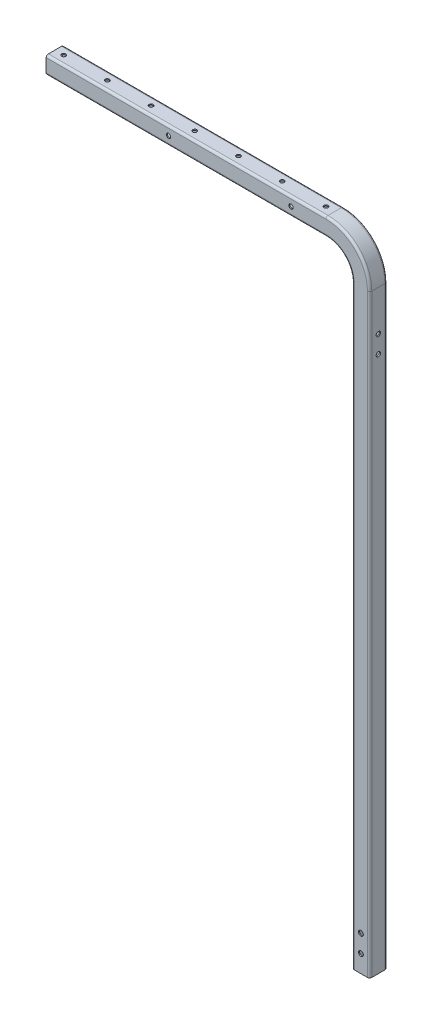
ISO-10303-21;
HEADER;
FILE_DESCRIPTION(('STEP AP214'),'2;1');
FILE_NAME('part.step','',(''),(''),'','','');
FILE_SCHEMA(('AUTOMOTIVE_DESIGN { 1 0 10303 214 1 1 1 1 }'));
ENDSEC;
DATA;
#1=APPLICATION_CONTEXT('core data for automotive mechanical design processes');
#2=APPLICATION_PROTOCOL_DEFINITION('international standard','automotive_design',2000,#1);
#3=PRODUCT_CONTEXT('',#1,'mechanical');
#4=PRODUCT('Part','Part','',(#3));
#5=PRODUCT_RELATED_PRODUCT_CATEGORY('part','',(#4));
#6=PRODUCT_DEFINITION_FORMATION('','',#4);
#7=PRODUCT_DEFINITION_CONTEXT('part definition',#1,'design');
#8=PRODUCT_DEFINITION('design','',#6,#7);
#9=PRODUCT_DEFINITION_SHAPE('','',#8);
#10=(LENGTH_UNIT() NAMED_UNIT(*) SI_UNIT(.MILLI.,.METRE.));
#11=(NAMED_UNIT(*) PLANE_ANGLE_UNIT() SI_UNIT($,.RADIAN.));
#12=(NAMED_UNIT(*) SI_UNIT($,.STERADIAN.) SOLID_ANGLE_UNIT());
#13=UNCERTAINTY_MEASURE_WITH_UNIT(LENGTH_MEASURE(1.E-05),#10,'distance_accuracy_value','');
#14=(GEOMETRIC_REPRESENTATION_CONTEXT(3) GLOBAL_UNCERTAINTY_ASSIGNED_CONTEXT((#13)) GLOBAL_UNIT_ASSIGNED_CONTEXT((#10,
#11,#12)) REPRESENTATION_CONTEXT('',''));
#15=CARTESIAN_POINT('',(0.,0.,0.));
#16=DIRECTION('',(0.,0.,1.));
#17=DIRECTION('',(1.,0.,0.));
#18=AXIS2_PLACEMENT_3D('',#15,#16,#17);
#19=CARTESIAN_POINT('',(12.7,12.7,0.));
#20=DIRECTION('',(0.,1.,0.));
#21=DIRECTION('',(0.,0.,1.));
#22=AXIS2_PLACEMENT_3D('',#19,#20,#21);
#23=CYLINDRICAL_SURFACE('',#22,2.99999999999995);
#24=CARTESIAN_POINT('',(12.7,12.7,0.));
#25=DIRECTION('',(0.,1.,0.));
#26=DIRECTION('',(0.,0.,1.));
#27=AXIS2_PLACEMENT_3D('',#24,#25,#26);
#28=CIRCLE('',#27,3.);
#29=CARTESIAN_POINT('',(12.7,12.7,3.));
#30=VERTEX_POINT('',#29);
#31=EDGE_CURVE('E49',#30,#30,#28,.T.);
#32=ORIENTED_EDGE('',*,*,#31,.T.);
#33=EDGE_LOOP('',(#32));
#34=FACE_BOUND('',#33,.T.);
#35=CARTESIAN_POINT('',(12.7,11.1125,0.));
#36=DIRECTION('',(0.,1.,0.));
#37=DIRECTION('',(0.,0.,1.));
#38=AXIS2_PLACEMENT_3D('',#35,#36,#37);
#39=CIRCLE('',#38,2.99999999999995);
#40=CARTESIAN_POINT('',(12.7,11.1125,2.99999999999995));
#41=VERTEX_POINT('',#40);
#42=EDGE_CURVE('E11',#41,#41,#39,.T.);
#43=ORIENTED_EDGE('',*,*,#42,.F.);
#44=EDGE_LOOP('',(#43));
#45=FACE_BOUND('',#44,.T.);
#46=ADVANCED_FACE('F41',(#34,#45),#23,.F.);
#47=CARTESIAN_POINT('',(76.2,12.7,0.));
#48=DIRECTION('',(0.,1.,0.));
#49=DIRECTION('',(0.,0.,1.));
#50=AXIS2_PLACEMENT_3D('',#47,#48,#49);
#51=CYLINDRICAL_SURFACE('',#50,2.99999999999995);
#52=CARTESIAN_POINT('',(76.2,12.7,0.));
#53=DIRECTION('',(0.,1.,0.));
#54=DIRECTION('',(0.,0.,1.));
#55=AXIS2_PLACEMENT_3D('',#52,#53,#54);
#56=CIRCLE('',#55,3.);
#57=CARTESIAN_POINT('',(76.2,12.7,3.));
#58=VERTEX_POINT('',#57);
#59=EDGE_CURVE('E578',#58,#58,#56,.T.);
#60=ORIENTED_EDGE('',*,*,#59,.T.);
#61=EDGE_LOOP('',(#60));
#62=FACE_BOUND('',#61,.T.);
#63=CARTESIAN_POINT('',(76.2,11.1125,0.));
#64=DIRECTION('',(0.,1.,0.));
#65=DIRECTION('',(0.,0.,1.));
#66=AXIS2_PLACEMENT_3D('',#63,#64,#65);
#67=CIRCLE('',#66,2.99999999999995);
#68=CARTESIAN_POINT('',(76.2,11.1125,2.99999999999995));
#69=VERTEX_POINT('',#68);
#70=EDGE_CURVE('E581',#69,#69,#67,.T.);
#71=ORIENTED_EDGE('',*,*,#70,.F.);
#72=EDGE_LOOP('',(#71));
#73=FACE_BOUND('',#72,.T.);
#74=ADVANCED_FACE('F799',(#62,#73),#51,.F.);
#75=CARTESIAN_POINT('',(139.7,12.7,0.));
#76=DIRECTION('',(0.,1.,0.));
#77=DIRECTION('',(0.,0.,1.));
#78=AXIS2_PLACEMENT_3D('',#75,#76,#77);
#79=CYLINDRICAL_SURFACE('',#78,2.99999999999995);
#80=CARTESIAN_POINT('',(139.7,12.7,0.));
#81=DIRECTION('',(0.,1.,0.));
#82=DIRECTION('',(0.,0.,1.));
#83=AXIS2_PLACEMENT_3D('',#80,#81,#82);
#84=CIRCLE('',#83,3.);
#85=CARTESIAN_POINT('',(139.7,12.7,3.));
#86=VERTEX_POINT('',#85);
#87=EDGE_CURVE('E572',#86,#86,#84,.T.);
#88=ORIENTED_EDGE('',*,*,#87,.T.);
#89=EDGE_LOOP('',(#88));
#90=FACE_BOUND('',#89,.T.);
#91=CARTESIAN_POINT('',(139.7,11.1125,0.));
#92=DIRECTION('',(0.,1.,0.));
#93=DIRECTION('',(0.,0.,1.));
#94=AXIS2_PLACEMENT_3D('',#91,#92,#93);
#95=CIRCLE('',#94,2.99999999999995);
#96=CARTESIAN_POINT('',(139.7,11.1125,2.99999999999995));
#97=VERTEX_POINT('',#96);
#98=EDGE_CURVE('E575',#97,#97,#95,.T.);
#99=ORIENTED_EDGE('',*,*,#98,.F.);
#100=EDGE_LOOP('',(#99));
#101=FACE_BOUND('',#100,.T.);
#102=ADVANCED_FACE('F804',(#90,#101),#79,.F.);
#103=CARTESIAN_POINT('',(203.2,12.7,0.));
#104=DIRECTION('',(0.,1.,0.));
#105=DIRECTION('',(0.,0.,1.));
#106=AXIS2_PLACEMENT_3D('',#103,#104,#105);
#107=CYLINDRICAL_SURFACE('',#106,2.99999999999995);
#108=CARTESIAN_POINT('',(203.2,12.7,0.));
#109=DIRECTION('',(0.,1.,0.));
#110=DIRECTION('',(0.,0.,1.));
#111=AXIS2_PLACEMENT_3D('',#108,#109,#110);
#112=CIRCLE('',#111,3.);
#113=CARTESIAN_POINT('',(203.2,12.7,3.));
#114=VERTEX_POINT('',#113);
#115=EDGE_CURVE('E566',#114,#114,#112,.T.);
#116=ORIENTED_EDGE('',*,*,#115,.T.);
#117=EDGE_LOOP('',(#116));
#118=FACE_BOUND('',#117,.T.);
#119=CARTESIAN_POINT('',(203.2,11.1125,0.));
#120=DIRECTION('',(0.,1.,0.));
#121=DIRECTION('',(0.,0.,1.));
#122=AXIS2_PLACEMENT_3D('',#119,#120,#121);
#123=CIRCLE('',#122,2.99999999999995);
#124=CARTESIAN_POINT('',(203.2,11.1125,2.99999999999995));
#125=VERTEX_POINT('',#124);
#126=EDGE_CURVE('E569',#125,#125,#123,.T.);
#127=ORIENTED_EDGE('',*,*,#126,.F.);
#128=EDGE_LOOP('',(#127));
#129=FACE_BOUND('',#128,.T.);
#130=ADVANCED_FACE('F959',(#118,#129),#107,.F.);
#131=CARTESIAN_POINT('',(266.7,12.7,0.));
#132=DIRECTION('',(0.,1.,0.));
#133=DIRECTION('',(0.,0.,1.));
#134=AXIS2_PLACEMENT_3D('',#131,#132,#133);
#135=CYLINDRICAL_SURFACE('',#134,2.99999999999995);
#136=CARTESIAN_POINT('',(266.7,12.7,0.));
#137=DIRECTION('',(0.,1.,0.));
#138=DIRECTION('',(0.,0.,1.));
#139=AXIS2_PLACEMENT_3D('',#136,#137,#138);
#140=CIRCLE('',#139,3.);
#141=CARTESIAN_POINT('',(266.7,12.7,3.));
#142=VERTEX_POINT('',#141);
#143=EDGE_CURVE('E560',#142,#142,#140,.T.);
#144=ORIENTED_EDGE('',*,*,#143,.T.);
#145=EDGE_LOOP('',(#144));
#146=FACE_BOUND('',#145,.T.);
#147=CARTESIAN_POINT('',(266.7,11.1125,0.));
#148=DIRECTION('',(0.,1.,0.));
#149=DIRECTION('',(0.,0.,1.));
#150=AXIS2_PLACEMENT_3D('',#147,#148,#149);
#151=CIRCLE('',#150,2.99999999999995);
#152=CARTESIAN_POINT('',(266.7,11.1125,2.99999999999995));
#153=VERTEX_POINT('',#152);
#154=EDGE_CURVE('E563',#153,#153,#151,.T.);
#155=ORIENTED_EDGE('',*,*,#154,.F.);
#156=EDGE_LOOP('',(#155));
#157=FACE_BOUND('',#156,.T.);
#158=ADVANCED_FACE('F955',(#146,#157),#135,.F.);
#159=CARTESIAN_POINT('',(12.7,12.7,0.));
#160=DIRECTION('',(0.,1.,0.));
#161=DIRECTION('',(0.,0.,1.));
#162=AXIS2_PLACEMENT_3D('',#159,#160,#161);
#163=CYLINDRICAL_SURFACE('',#162,2.99999999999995);
#164=CARTESIAN_POINT('',(12.7,-12.7,0.));
#165=DIRECTION('',(0.,-1.,0.));
#166=DIRECTION('',(0.,0.,-1.));
#167=AXIS2_PLACEMENT_3D('',#164,#165,#166);
#168=CIRCLE('',#167,2.99999999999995);
#169=CARTESIAN_POINT('',(12.7,-12.7,-2.99999999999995));
#170=VERTEX_POINT('',#169);
#171=EDGE_CURVE('E554',#170,#170,#168,.T.);
#172=ORIENTED_EDGE('',*,*,#171,.T.);
#173=EDGE_LOOP('',(#172));
#174=FACE_BOUND('',#173,.T.);
#175=CARTESIAN_POINT('',(12.7,-11.1125,0.));
#176=DIRECTION('',(0.,-1.,0.));
#177=DIRECTION('',(0.,0.,-1.));
#178=AXIS2_PLACEMENT_3D('',#175,#176,#177);
#179=CIRCLE('',#178,2.99999999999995);
#180=CARTESIAN_POINT('',(12.7,-11.1125,-2.99999999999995));
#181=VERTEX_POINT('',#180);
#182=EDGE_CURVE('E557',#181,#181,#179,.T.);
#183=ORIENTED_EDGE('',*,*,#182,.F.);
#184=EDGE_LOOP('',(#183));
#185=FACE_BOUND('',#184,.T.);
#186=ADVANCED_FACE('F951',(#174,#185),#163,.F.);
#187=CARTESIAN_POINT('',(76.2,12.7,0.));
#188=DIRECTION('',(0.,1.,0.));
#189=DIRECTION('',(0.,0.,1.));
#190=AXIS2_PLACEMENT_3D('',#187,#188,#189);
#191=CYLINDRICAL_SURFACE('',#190,2.99999999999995);
#192=CARTESIAN_POINT('',(76.2,-12.7,0.));
#193=DIRECTION('',(0.,-1.,0.));
#194=DIRECTION('',(0.,0.,-1.));
#195=AXIS2_PLACEMENT_3D('',#192,#193,#194);
#196=CIRCLE('',#195,2.99999999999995);
#197=CARTESIAN_POINT('',(76.2,-12.7,-2.99999999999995));
#198=VERTEX_POINT('',#197);
#199=EDGE_CURVE('E548',#198,#198,#196,.T.);
#200=ORIENTED_EDGE('',*,*,#199,.T.);
#201=EDGE_LOOP('',(#200));
#202=FACE_BOUND('',#201,.T.);
#203=CARTESIAN_POINT('',(76.2,-11.1125,0.));
#204=DIRECTION('',(0.,-1.,0.));
#205=DIRECTION('',(0.,0.,-1.));
#206=AXIS2_PLACEMENT_3D('',#203,#204,#205);
#207=CIRCLE('',#206,2.99999999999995);
#208=CARTESIAN_POINT('',(76.2,-11.1125,-2.99999999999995));
#209=VERTEX_POINT('',#208);
#210=EDGE_CURVE('E551',#209,#209,#207,.T.);
#211=ORIENTED_EDGE('',*,*,#210,.F.);
#212=EDGE_LOOP('',(#211));
#213=FACE_BOUND('',#212,.T.);
#214=ADVANCED_FACE('F947',(#202,#213),#191,.F.);
#215=CARTESIAN_POINT('',(139.7,12.7,0.));
#216=DIRECTION('',(0.,1.,0.));
#217=DIRECTION('',(0.,0.,1.));
#218=AXIS2_PLACEMENT_3D('',#215,#216,#217);
#219=CYLINDRICAL_SURFACE('',#218,2.99999999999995);
#220=CARTESIAN_POINT('',(139.7,-12.7,0.));
#221=DIRECTION('',(0.,-1.,0.));
#222=DIRECTION('',(0.,0.,-1.));
#223=AXIS2_PLACEMENT_3D('',#220,#221,#222);
#224=CIRCLE('',#223,2.99999999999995);
#225=CARTESIAN_POINT('',(139.7,-12.7,-2.99999999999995));
#226=VERTEX_POINT('',#225);
#227=EDGE_CURVE('E542',#226,#226,#224,.T.);
#228=ORIENTED_EDGE('',*,*,#227,.T.);
#229=EDGE_LOOP('',(#228));
#230=FACE_BOUND('',#229,.T.);
#231=CARTESIAN_POINT('',(139.7,-11.1125,0.));
#232=DIRECTION('',(0.,-1.,0.));
#233=DIRECTION('',(0.,0.,-1.));
#234=AXIS2_PLACEMENT_3D('',#231,#232,#233);
#235=CIRCLE('',#234,2.99999999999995);
#236=CARTESIAN_POINT('',(139.7,-11.1125,-2.99999999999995));
#237=VERTEX_POINT('',#236);
#238=EDGE_CURVE('E545',#237,#237,#235,.T.);
#239=ORIENTED_EDGE('',*,*,#238,.F.);
#240=EDGE_LOOP('',(#239));
#241=FACE_BOUND('',#240,.T.);
#242=ADVANCED_FACE('F943',(#230,#241),#219,.F.);
#243=CARTESIAN_POINT('',(203.2,12.7,0.));
#244=DIRECTION('',(0.,1.,0.));
#245=DIRECTION('',(0.,0.,1.));
#246=AXIS2_PLACEMENT_3D('',#243,#244,#245);
#247=CYLINDRICAL_SURFACE('',#246,2.99999999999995);
#248=CARTESIAN_POINT('',(203.2,-12.7,0.));
#249=DIRECTION('',(0.,-1.,0.));
#250=DIRECTION('',(0.,0.,-1.));
#251=AXIS2_PLACEMENT_3D('',#248,#249,#250);
#252=CIRCLE('',#251,2.99999999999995);
#253=CARTESIAN_POINT('',(203.2,-12.7,-2.99999999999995));
#254=VERTEX_POINT('',#253);
#255=EDGE_CURVE('E536',#254,#254,#252,.T.);
#256=ORIENTED_EDGE('',*,*,#255,.T.);
#257=EDGE_LOOP('',(#256));
#258=FACE_BOUND('',#257,.T.);
#259=CARTESIAN_POINT('',(203.2,-11.1125,0.));
#260=DIRECTION('',(0.,-1.,0.));
#261=DIRECTION('',(0.,0.,-1.));
#262=AXIS2_PLACEMENT_3D('',#259,#260,#261);
#263=CIRCLE('',#262,2.99999999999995);
#264=CARTESIAN_POINT('',(203.2,-11.1125,-2.99999999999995));
#265=VERTEX_POINT('',#264);
#266=EDGE_CURVE('E539',#265,#265,#263,.T.);
#267=ORIENTED_EDGE('',*,*,#266,.F.);
#268=EDGE_LOOP('',(#267));
#269=FACE_BOUND('',#268,.T.);
#270=ADVANCED_FACE('F939',(#258,#269),#247,.F.);
#271=CARTESIAN_POINT('',(266.7,12.7,0.));
#272=DIRECTION('',(0.,1.,0.));
#273=DIRECTION('',(0.,0.,1.));
#274=AXIS2_PLACEMENT_3D('',#271,#272,#273);
#275=CYLINDRICAL_SURFACE('',#274,2.99999999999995);
#276=CARTESIAN_POINT('',(266.7,-12.7,0.));
#277=DIRECTION('',(0.,-1.,0.));
#278=DIRECTION('',(0.,0.,-1.));
#279=AXIS2_PLACEMENT_3D('',#276,#277,#278);
#280=CIRCLE('',#279,2.99999999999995);
#281=CARTESIAN_POINT('',(266.7,-12.7,-2.99999999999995));
#282=VERTEX_POINT('',#281);
#283=EDGE_CURVE('E504',#282,#282,#280,.T.);
#284=ORIENTED_EDGE('',*,*,#283,.T.);
#285=EDGE_LOOP('',(#284));
#286=FACE_BOUND('',#285,.T.);
#287=CARTESIAN_POINT('',(266.7,-11.1125,0.));
#288=DIRECTION('',(0.,-1.,0.));
#289=DIRECTION('',(0.,0.,-1.));
#290=AXIS2_PLACEMENT_3D('',#287,#288,#289);
#291=CIRCLE('',#290,2.99999999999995);
#292=CARTESIAN_POINT('',(266.7,-11.1125,-2.99999999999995));
#293=VERTEX_POINT('',#292);
#294=EDGE_CURVE('E533',#293,#293,#291,.T.);
#295=ORIENTED_EDGE('',*,*,#294,.F.);
#296=EDGE_LOOP('',(#295));
#297=FACE_BOUND('',#296,.T.);
#298=ADVANCED_FACE('F854',(#286,#297),#275,.F.);
#299=CARTESIAN_POINT('',(469.9,-914.4,12.7));
#300=DIRECTION('',(0.,-1.,0.));
#301=DIRECTION('',(0.,0.,-1.));
#302=AXIS2_PLACEMENT_3D('',#299,#300,#301);
#303=PLANE('',#302);
#304=DIRECTION('',(0.,0.,-1.));
#305=VECTOR('',#304,1.);
#306=CARTESIAN_POINT('',(469.9,-914.4,12.7));
#307=LINE('',#306,#305);
#308=CARTESIAN_POINT('',(469.9,-914.4,9.525));
#309=VERTEX_POINT('',#308);
#310=CARTESIAN_POINT('',(469.9,-914.4,-9.52499999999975));
#311=VERTEX_POINT('',#310);
#312=EDGE_CURVE('E396',#309,#311,#307,.T.);
#313=ORIENTED_EDGE('',*,*,#312,.F.);
#314=CARTESIAN_POINT('',(466.725,-914.4,9.525));
#315=DIRECTION('',(0.,-1.,0.));
#316=DIRECTION('',(1.,0.,0.));
#317=AXIS2_PLACEMENT_3D('',#314,#315,#316);
#318=CIRCLE('',#317,3.175);
#319=CARTESIAN_POINT('',(466.725,-914.4,12.7));
#320=VERTEX_POINT('',#319);
#321=EDGE_CURVE('E424',#309,#320,#318,.T.);
#322=ORIENTED_EDGE('',*,*,#321,.T.);
#323=DIRECTION('',(-1.,0.,0.));
#324=VECTOR('',#323,1.);
#325=CARTESIAN_POINT('',(469.9,-914.4,12.7));
#326=LINE('',#325,#324);
#327=CARTESIAN_POINT('',(447.675,-914.4,12.7));
#328=VERTEX_POINT('',#327);
#329=EDGE_CURVE('E392',#320,#328,#326,.T.);
#330=ORIENTED_EDGE('',*,*,#329,.T.);
#331=CARTESIAN_POINT('',(447.675,-914.4,9.525));
#332=DIRECTION('',(0.,-1.,0.));
#333=DIRECTION('',(1.,0.,0.));
#334=AXIS2_PLACEMENT_3D('',#331,#332,#333);
#335=CIRCLE('',#334,3.175);
#336=CARTESIAN_POINT('',(444.5,-914.4,9.525));
#337=VERTEX_POINT('',#336);
#338=EDGE_CURVE('E415',#328,#337,#335,.T.);
#339=ORIENTED_EDGE('',*,*,#338,.T.);
#340=DIRECTION('',(0.,0.,1.));
#341=VECTOR('',#340,1.);
#342=CARTESIAN_POINT('',(444.5,-914.4,-12.7));
#343=LINE('',#342,#341);
#344=CARTESIAN_POINT('',(444.5,-914.4,-9.52499999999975));
#345=VERTEX_POINT('',#344);
#346=EDGE_CURVE('E404',#345,#337,#343,.T.);
#347=ORIENTED_EDGE('',*,*,#346,.F.);
#348=CARTESIAN_POINT('',(447.675,-914.4,-9.52499999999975));
#349=DIRECTION('',(0.,-1.,0.));
#350=DIRECTION('',(1.,0.,0.));
#351=AXIS2_PLACEMENT_3D('',#348,#349,#350);
#352=CIRCLE('',#351,3.175);
#353=CARTESIAN_POINT('',(447.675,-914.4,-12.7));
#354=VERTEX_POINT('',#353);
#355=EDGE_CURVE('E418',#345,#354,#352,.T.);
#356=ORIENTED_EDGE('',*,*,#355,.T.);
#357=DIRECTION('',(1.,0.,0.));
#358=VECTOR('',#357,1.);
#359=CARTESIAN_POINT('',(444.5,-914.4,-12.7));
#360=LINE('',#359,#358);
#361=CARTESIAN_POINT('',(466.725,-914.4,-12.7));
#362=VERTEX_POINT('',#361);
#363=EDGE_CURVE('E400',#354,#362,#360,.T.);
#364=ORIENTED_EDGE('',*,*,#363,.T.);
#365=CARTESIAN_POINT('',(466.725,-914.4,-9.52499999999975));
#366=DIRECTION('',(0.,-1.,0.));
#367=DIRECTION('',(1.,0.,0.));
#368=AXIS2_PLACEMENT_3D('',#365,#366,#367);
#369=CIRCLE('',#368,3.175);
#370=EDGE_CURVE('E421',#362,#311,#369,.T.);
#371=ORIENTED_EDGE('',*,*,#370,.T.);
#372=EDGE_LOOP('',(#313,#322,#330,#339,#347,#356,#364,#371));
#373=FACE_BOUND('',#372,.T.);
#374=CARTESIAN_POINT('',(466.725,-914.4,9.525));
#375=DIRECTION('',(0.,-1.,0.));
#376=DIRECTION('',(1.,0.,0.));
#377=AXIS2_PLACEMENT_3D('',#374,#375,#376);
#378=CIRCLE('',#377,1.5875);
#379=CARTESIAN_POINT('',(468.3125,-914.4,9.525));
#380=VERTEX_POINT('',#379);
#381=CARTESIAN_POINT('',(466.725,-914.4,11.1125));
#382=VERTEX_POINT('',#381);
#383=EDGE_CURVE('E323',#380,#382,#378,.T.);
#384=ORIENTED_EDGE('',*,*,#383,.F.);
#385=DIRECTION('',(0.,0.,-1.));
#386=VECTOR('',#385,1.);
#387=CARTESIAN_POINT('',(468.3125,-914.4,12.7));
#388=LINE('',#387,#386);
#389=CARTESIAN_POINT('',(468.3125,-914.4,-9.52499999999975));
#390=VERTEX_POINT('',#389);
#391=EDGE_CURVE('E320',#380,#390,#388,.T.);
#392=ORIENTED_EDGE('',*,*,#391,.T.);
#393=CARTESIAN_POINT('',(466.725,-914.4,-9.52499999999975));
#394=DIRECTION('',(0.,-1.,0.));
#395=DIRECTION('',(1.,0.,0.));
#396=AXIS2_PLACEMENT_3D('',#393,#394,#395);
#397=CIRCLE('',#396,1.5875);
#398=CARTESIAN_POINT('',(466.725,-914.4,-11.1124999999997));
#399=VERTEX_POINT('',#398);
#400=EDGE_CURVE('E317',#399,#390,#397,.T.);
#401=ORIENTED_EDGE('',*,*,#400,.F.);
#402=DIRECTION('',(1.,0.,0.));
#403=VECTOR('',#402,1.);
#404=CARTESIAN_POINT('',(406.4,-914.4,-11.1124999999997));
#405=LINE('',#404,#403);
#406=CARTESIAN_POINT('',(447.675,-914.4,-11.1124999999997));
#407=VERTEX_POINT('',#406);
#408=EDGE_CURVE('E57',#407,#399,#405,.T.);
#409=ORIENTED_EDGE('',*,*,#408,.F.);
#410=CARTESIAN_POINT('',(447.675,-914.4,-9.52499999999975));
#411=DIRECTION('',(0.,-1.,0.));
#412=DIRECTION('',(1.,0.,0.));
#413=AXIS2_PLACEMENT_3D('',#410,#411,#412);
#414=CIRCLE('',#413,1.5875);
#415=CARTESIAN_POINT('',(446.0875,-914.4,-9.52499999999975));
#416=VERTEX_POINT('',#415);
#417=EDGE_CURVE('E314',#416,#407,#414,.T.);
#418=ORIENTED_EDGE('',*,*,#417,.F.);
#419=DIRECTION('',(0.,0.,1.));
#420=VECTOR('',#419,1.);
#421=CARTESIAN_POINT('',(446.0875,-914.4,12.7));
#422=LINE('',#421,#420);
#423=CARTESIAN_POINT('',(446.0875,-914.4,9.525));
#424=VERTEX_POINT('',#423);
#425=EDGE_CURVE('E310',#416,#424,#422,.T.);
#426=ORIENTED_EDGE('',*,*,#425,.T.);
#427=CARTESIAN_POINT('',(447.675,-914.4,9.525));
#428=DIRECTION('',(0.,-1.,0.));
#429=DIRECTION('',(1.,0.,0.));
#430=AXIS2_PLACEMENT_3D('',#427,#428,#429);
#431=CIRCLE('',#430,1.5875);
#432=CARTESIAN_POINT('',(447.675,-914.4,11.1125));
#433=VERTEX_POINT('',#432);
#434=EDGE_CURVE('E262',#433,#424,#431,.T.);
#435=ORIENTED_EDGE('',*,*,#434,.F.);
#436=DIRECTION('',(-1.,0.,0.));
#437=VECTOR('',#436,1.);
#438=CARTESIAN_POINT('',(406.4,-914.4,11.1125));
#439=LINE('',#438,#437);
#440=EDGE_CURVE('E279',#382,#433,#439,.T.);
#441=ORIENTED_EDGE('',*,*,#440,.F.);
#442=EDGE_LOOP('',(#384,#392,#401,#409,#418,#426,#435,#441));
#443=FACE_BOUND('',#442,.T.);
#444=ADVANCED_FACE('F769',(#373,#443),#303,.T.);
#445=CARTESIAN_POINT('',(444.5,-50.8,-12.7));
#446=DIRECTION('',(1.,0.,0.));
#447=DIRECTION('',(0.,1.,0.));
#448=AXIS2_PLACEMENT_3D('',#445,#446,#447);
#449=PLANE('',#448);
#450=CARTESIAN_POINT('',(444.5,-134.9375,0.));
#451=DIRECTION('',(1.,0.,0.));
#452=DIRECTION('',(0.,1.,0.));
#453=AXIS2_PLACEMENT_3D('',#450,#451,#452);
#454=CIRCLE('',#453,3.17499999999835);
#455=CARTESIAN_POINT('',(444.5,-131.762500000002,0.));
#456=VERTEX_POINT('',#455);
#457=EDGE_CURVE('E629',#456,#456,#454,.T.);
#458=ORIENTED_EDGE('',*,*,#457,.T.);
#459=EDGE_LOOP('',(#458));
#460=FACE_BOUND('',#459,.T.);
#461=CARTESIAN_POINT('',(444.5,-109.5375,0.));
#462=DIRECTION('',(1.,0.,0.));
#463=DIRECTION('',(0.,1.,0.));
#464=AXIS2_PLACEMENT_3D('',#461,#462,#463);
#465=CIRCLE('',#464,3.17499999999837);
#466=CARTESIAN_POINT('',(444.5,-106.362500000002,0.));
#467=VERTEX_POINT('',#466);
#468=EDGE_CURVE('E636',#467,#467,#465,.T.);
#469=ORIENTED_EDGE('',*,*,#468,.T.);
#470=EDGE_LOOP('',(#469));
#471=FACE_BOUND('',#470,.T.);
#472=DIRECTION('',(0.,0.,1.));
#473=VECTOR('',#472,1.);
#474=CARTESIAN_POINT('',(444.5,-50.8,-12.7));
#475=LINE('',#474,#473);
#476=CARTESIAN_POINT('',(444.5,-50.8,-9.52499999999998));
#477=VERTEX_POINT('',#476);
#478=CARTESIAN_POINT('',(444.5,-50.8,9.525));
#479=VERTEX_POINT('',#478);
#480=EDGE_CURVE('E388',#477,#479,#475,.T.);
#481=ORIENTED_EDGE('',*,*,#480,.F.);
#482=DIRECTION('',(0.,-1.,0.));
#483=VECTOR('',#482,1.);
#484=CARTESIAN_POINT('',(444.5,-50.8,-9.52499999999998));
#485=LINE('',#484,#483);
#486=EDGE_CURVE('E468',#477,#345,#485,.T.);
#487=ORIENTED_EDGE('',*,*,#486,.T.);
#488=ORIENTED_EDGE('',*,*,#346,.T.);
#489=DIRECTION('',(0.,-1.,0.));
#490=VECTOR('',#489,1.);
#491=CARTESIAN_POINT('',(444.5,-50.8,9.525));
#492=LINE('',#491,#490);
#493=EDGE_CURVE('E465',#337,#479,#492,.F.);
#494=ORIENTED_EDGE('',*,*,#493,.T.);
#495=EDGE_LOOP('',(#481,#487,#488,#494));
#496=FACE_BOUND('',#495,.T.);
#497=ADVANCED_FACE('F853',(#460,#471,#496),#449,.F.);
#498=CARTESIAN_POINT('',(469.9,-50.8,12.7));
#499=DIRECTION('',(-1.,0.,0.));
#500=DIRECTION('',(0.,-1.,0.));
#501=AXIS2_PLACEMENT_3D('',#498,#499,#500);
#502=PLANE('',#501);
#503=CARTESIAN_POINT('',(469.9,-134.9375,0.));
#504=DIRECTION('',(1.,0.,0.));
#505=DIRECTION('',(0.,1.,0.));
#506=AXIS2_PLACEMENT_3D('',#503,#504,#505);
#507=CIRCLE('',#506,3.17499999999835);
#508=CARTESIAN_POINT('',(469.9,-131.762500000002,0.));
#509=VERTEX_POINT('',#508);
#510=EDGE_CURVE('E595',#509,#509,#507,.T.);
#511=ORIENTED_EDGE('',*,*,#510,.F.);
#512=EDGE_LOOP('',(#511));
#513=FACE_BOUND('',#512,.T.);
#514=CARTESIAN_POINT('',(469.9,-109.5375,0.));
#515=DIRECTION('',(1.,0.,0.));
#516=DIRECTION('',(0.,1.,0.));
#517=AXIS2_PLACEMENT_3D('',#514,#515,#516);
#518=CIRCLE('',#517,3.17499999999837);
#519=CARTESIAN_POINT('',(469.9,-106.362500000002,0.));
#520=VERTEX_POINT('',#519);
#521=EDGE_CURVE('E590',#520,#520,#518,.T.);
#522=ORIENTED_EDGE('',*,*,#521,.F.);
#523=EDGE_LOOP('',(#522));
#524=FACE_BOUND('',#523,.T.);
#525=DIRECTION('',(0.,0.,-1.));
#526=VECTOR('',#525,1.);
#527=CARTESIAN_POINT('',(469.9,-50.8,12.7));
#528=LINE('',#527,#526);
#529=CARTESIAN_POINT('',(469.9,-50.8,9.525));
#530=VERTEX_POINT('',#529);
#531=CARTESIAN_POINT('',(469.9,-50.8,-9.52499999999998));
#532=VERTEX_POINT('',#531);
#533=EDGE_CURVE('E368',#530,#532,#528,.T.);
#534=ORIENTED_EDGE('',*,*,#533,.F.);
#535=DIRECTION('',(0.,-1.,0.));
#536=VECTOR('',#535,1.);
#537=CARTESIAN_POINT('',(469.9,-50.8,9.525));
#538=LINE('',#537,#536);
#539=EDGE_CURVE('E411',#530,#309,#538,.T.);
#540=ORIENTED_EDGE('',*,*,#539,.T.);
#541=ORIENTED_EDGE('',*,*,#312,.T.);
#542=DIRECTION('',(0.,-1.,0.));
#543=VECTOR('',#542,1.);
#544=CARTESIAN_POINT('',(469.9,-50.8,-9.52499999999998));
#545=LINE('',#544,#543);
#546=EDGE_CURVE('E408',#311,#532,#545,.F.);
#547=ORIENTED_EDGE('',*,*,#546,.T.);
#548=EDGE_LOOP('',(#534,#540,#541,#547));
#549=FACE_BOUND('',#548,.T.);
#550=ADVANCED_FACE('F882',(#513,#524,#549),#502,.F.);
#551=CARTESIAN_POINT('',(406.4,-50.8,0.));
#552=DIRECTION('',(0.,0.,-1.));
#553=DIRECTION('',(-1.,0.,0.));
#554=AXIS2_PLACEMENT_3D('',#551,#552,#553);
#555=CYLINDRICAL_SURFACE('',#554,38.1);
#556=DIRECTION('',(0.,0.,1.));
#557=VECTOR('',#556,1.);
#558=CARTESIAN_POINT('',(406.4,-12.7,-12.7));
#559=LINE('',#558,#557);
#560=CARTESIAN_POINT('',(406.4,-12.7,-9.525));
#561=VERTEX_POINT('',#560);
#562=CARTESIAN_POINT('',(406.4,-12.7,9.525));
#563=VERTEX_POINT('',#562);
#564=EDGE_CURVE('E359',#561,#563,#559,.T.);
#565=ORIENTED_EDGE('',*,*,#564,.F.);
#566=CARTESIAN_POINT('',(406.4,-50.8,-9.52499999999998));
#567=DIRECTION('',(0.,0.,1.));
#568=DIRECTION('',(0.,-1.,0.));
#569=AXIS2_PLACEMENT_3D('',#566,#567,#568);
#570=CIRCLE('',#569,38.1);
#571=EDGE_CURVE('E481',#561,#477,#570,.F.);
#572=ORIENTED_EDGE('',*,*,#571,.T.);
#573=ORIENTED_EDGE('',*,*,#480,.T.);
#574=CARTESIAN_POINT('',(406.4,-50.8,9.525));
#575=DIRECTION('',(0.,0.,-1.));
#576=DIRECTION('',(-1.,0.,0.));
#577=AXIS2_PLACEMENT_3D('',#574,#575,#576);
#578=CIRCLE('',#577,38.1);
#579=EDGE_CURVE('E478',#479,#563,#578,.F.);
#580=ORIENTED_EDGE('',*,*,#579,.T.);
#581=EDGE_LOOP('',(#565,#572,#573,#580));
#582=FACE_BOUND('',#581,.T.);
#583=ADVANCED_FACE('F878',(#582),#555,.F.);
#584=CARTESIAN_POINT('',(406.4,-50.8,0.));
#585=DIRECTION('',(0.,0.,-1.));
#586=DIRECTION('',(-1.,0.,0.));
#587=AXIS2_PLACEMENT_3D('',#584,#585,#586);
#588=CYLINDRICAL_SURFACE('',#587,63.5);
#589=DIRECTION('',(0.,0.,-1.));
#590=VECTOR('',#589,1.);
#591=CARTESIAN_POINT('',(406.4,12.7,12.7));
#592=LINE('',#591,#590);
#593=CARTESIAN_POINT('',(406.4,12.7,9.525));
#594=VERTEX_POINT('',#593);
#595=CARTESIAN_POINT('',(406.4,12.7,-9.525));
#596=VERTEX_POINT('',#595);
#597=EDGE_CURVE('E363',#594,#596,#592,.T.);
#598=ORIENTED_EDGE('',*,*,#597,.F.);
#599=CARTESIAN_POINT('',(406.4,-50.8,9.525));
#600=DIRECTION('',(0.,0.,-1.));
#601=DIRECTION('',(-1.,0.,0.));
#602=AXIS2_PLACEMENT_3D('',#599,#600,#601);
#603=CIRCLE('',#602,63.5);
#604=EDGE_CURVE('E475',#594,#530,#603,.T.);
#605=ORIENTED_EDGE('',*,*,#604,.T.);
#606=ORIENTED_EDGE('',*,*,#533,.T.);
#607=CARTESIAN_POINT('',(406.4,-50.8,-9.52499999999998));
#608=DIRECTION('',(0.,0.,1.));
#609=DIRECTION('',(0.,-1.,0.));
#610=AXIS2_PLACEMENT_3D('',#607,#608,#609);
#611=CIRCLE('',#610,63.5);
#612=EDGE_CURVE('E472',#532,#596,#611,.T.);
#613=ORIENTED_EDGE('',*,*,#612,.T.);
#614=EDGE_LOOP('',(#598,#605,#606,#613));
#615=FACE_BOUND('',#614,.T.);
#616=ADVANCED_FACE('F874',(#615),#588,.T.);
#617=CARTESIAN_POINT('',(406.4,12.7,12.7));
#618=DIRECTION('',(0.,0.,-1.));
#619=DIRECTION('',(-1.,0.,0.));
#620=AXIS2_PLACEMENT_3D('',#617,#618,#619);
#621=PLANE('',#620);
#622=CARTESIAN_POINT('',(457.2,-863.6,12.7000000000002));
#623=DIRECTION('',(0.,0.,-1.));
#624=DIRECTION('',(0.,1.,0.));
#625=AXIS2_PLACEMENT_3D('',#622,#623,#624);
#626=CIRCLE('',#625,3.57187499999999);
#627=CARTESIAN_POINT('',(457.2,-860.028125,12.7000000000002));
#628=VERTEX_POINT('',#627);
#629=EDGE_CURVE('E1409',#628,#628,#626,.T.);
#630=ORIENTED_EDGE('',*,*,#629,.T.);
#631=EDGE_LOOP('',(#630));
#632=FACE_BOUND('',#631,.T.);
#633=CARTESIAN_POINT('',(457.2,-889.,12.7000000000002));
#634=DIRECTION('',(0.,0.,-1.));
#635=DIRECTION('',(0.,1.,0.));
#636=AXIS2_PLACEMENT_3D('',#633,#634,#635);
#637=CIRCLE('',#636,3.57187499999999);
#638=CARTESIAN_POINT('',(457.2,-885.428125,12.7000000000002));
#639=VERTEX_POINT('',#638);
#640=EDGE_CURVE('E1416',#639,#639,#637,.T.);
#641=ORIENTED_EDGE('',*,*,#640,.T.);
#642=EDGE_LOOP('',(#641));
#643=FACE_BOUND('',#642,.T.);
#644=CARTESIAN_POINT('',(177.8,0.,12.7));
#645=DIRECTION('',(0.,0.,1.));
#646=DIRECTION('',(1.,0.,0.));
#647=AXIS2_PLACEMENT_3D('',#644,#645,#646);
#648=CIRCLE('',#647,3.17499999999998);
#649=CARTESIAN_POINT('',(180.975,0.,12.7));
#650=VERTEX_POINT('',#649);
#651=EDGE_CURVE('E603',#650,#650,#648,.T.);
#652=ORIENTED_EDGE('',*,*,#651,.F.);
#653=EDGE_LOOP('',(#652));
#654=FACE_BOUND('',#653,.T.);
#655=CARTESIAN_POINT('',(355.6,0.,12.7));
#656=DIRECTION('',(0.,0.,1.));
#657=DIRECTION('',(1.,0.,0.));
#658=AXIS2_PLACEMENT_3D('',#655,#656,#657);
#659=CIRCLE('',#658,3.17499999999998);
#660=CARTESIAN_POINT('',(358.775,0.,12.7));
#661=VERTEX_POINT('',#660);
#662=EDGE_CURVE('E599',#661,#661,#659,.T.);
#663=ORIENTED_EDGE('',*,*,#662,.F.);
#664=EDGE_LOOP('',(#663));
#665=FACE_BOUND('',#664,.T.);
#666=ORIENTED_EDGE('',*,*,#329,.F.);
#667=DIRECTION('',(0.,-1.,0.));
#668=VECTOR('',#667,1.);
#669=CARTESIAN_POINT('',(466.725,12.7,12.7));
#670=LINE('',#669,#668);
#671=CARTESIAN_POINT('',(466.725,-50.8,12.7));
#672=VERTEX_POINT('',#671);
#673=EDGE_CURVE('E443',#320,#672,#670,.F.);
#674=ORIENTED_EDGE('',*,*,#673,.T.);
#675=CARTESIAN_POINT('',(406.4,-50.8,12.7));
#676=DIRECTION('',(0.,0.,-1.));
#677=DIRECTION('',(-1.,0.,0.));
#678=AXIS2_PLACEMENT_3D('',#675,#676,#677);
#679=CIRCLE('',#678,60.325);
#680=CARTESIAN_POINT('',(406.4,9.52500000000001,12.7));
#681=VERTEX_POINT('',#680);
#682=EDGE_CURVE('E440',#672,#681,#679,.F.);
#683=ORIENTED_EDGE('',*,*,#682,.T.);
#684=DIRECTION('',(-1.,0.,0.));
#685=VECTOR('',#684,1.);
#686=CARTESIAN_POINT('',(0.,9.52500000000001,12.7));
#687=LINE('',#686,#685);
#688=CARTESIAN_POINT('',(0.,9.52500000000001,12.7));
#689=VERTEX_POINT('',#688);
#690=EDGE_CURVE('E437',#681,#689,#687,.T.);
#691=ORIENTED_EDGE('',*,*,#690,.T.);
#692=DIRECTION('',(0.,-1.,0.));
#693=VECTOR('',#692,1.);
#694=CARTESIAN_POINT('',(0.,12.7,12.7));
#695=LINE('',#694,#693);
#696=CARTESIAN_POINT('',(0.,-9.52499999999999,12.7));
#697=VERTEX_POINT('',#696);
#698=EDGE_CURVE('E369',#689,#697,#695,.T.);
#699=ORIENTED_EDGE('',*,*,#698,.T.);
#700=DIRECTION('',(-1.,0.,0.));
#701=VECTOR('',#700,1.);
#702=CARTESIAN_POINT('',(406.4,-9.52499999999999,12.7));
#703=LINE('',#702,#701);
#704=CARTESIAN_POINT('',(406.4,-9.52499999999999,12.7));
#705=VERTEX_POINT('',#704);
#706=EDGE_CURVE('E427',#697,#705,#703,.F.);
#707=ORIENTED_EDGE('',*,*,#706,.T.);
#708=CARTESIAN_POINT('',(406.4,-50.8,12.7));
#709=DIRECTION('',(0.,0.,-1.));
#710=DIRECTION('',(-1.,0.,0.));
#711=AXIS2_PLACEMENT_3D('',#708,#709,#710);
#712=CIRCLE('',#711,41.275);
#713=CARTESIAN_POINT('',(447.675,-50.8,12.7));
#714=VERTEX_POINT('',#713);
#715=EDGE_CURVE('E430',#705,#714,#712,.T.);
#716=ORIENTED_EDGE('',*,*,#715,.T.);
#717=DIRECTION('',(0.,-1.,0.));
#718=VECTOR('',#717,1.);
#719=CARTESIAN_POINT('',(447.675,12.7,12.7));
#720=LINE('',#719,#718);
#721=EDGE_CURVE('E433',#714,#328,#720,.T.);
#722=ORIENTED_EDGE('',*,*,#721,.T.);
#723=EDGE_LOOP('',(#666,#674,#683,#691,#699,#707,#716,#722));
#724=FACE_BOUND('',#723,.T.);
#725=ADVANCED_FACE('F870',(#632,#643,#654,#665,#724),#621,.F.);
#726=CARTESIAN_POINT('',(406.4,-12.7,-12.7));
#727=DIRECTION('',(0.,-1.,0.));
#728=DIRECTION('',(0.,0.,-1.));
#729=AXIS2_PLACEMENT_3D('',#726,#727,#728);
#730=PLANE('',#729);
#731=CARTESIAN_POINT('',(330.2,-12.7,0.));
#732=DIRECTION('',(0.,-1.,0.));
#733=DIRECTION('',(0.,0.,-1.));
#734=AXIS2_PLACEMENT_3D('',#731,#732,#733);
#735=CIRCLE('',#734,2.99999999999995);
#736=CARTESIAN_POINT('',(330.2,-12.7,-2.99999999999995));
#737=VERTEX_POINT('',#736);
#738=EDGE_CURVE('E645',#737,#737,#735,.T.);
#739=ORIENTED_EDGE('',*,*,#738,.F.);
#740=EDGE_LOOP('',(#739));
#741=FACE_BOUND('',#740,.T.);
#742=CARTESIAN_POINT('',(393.7,-12.7,0.));
#743=DIRECTION('',(0.,-1.,0.));
#744=DIRECTION('',(0.,0.,-1.));
#745=AXIS2_PLACEMENT_3D('',#742,#743,#744);
#746=CIRCLE('',#745,2.99999999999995);
#747=CARTESIAN_POINT('',(393.7,-12.7,-2.99999999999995));
#748=VERTEX_POINT('',#747);
#749=EDGE_CURVE('E654',#748,#748,#746,.T.);
#750=ORIENTED_EDGE('',*,*,#749,.F.);
#751=EDGE_LOOP('',(#750));
#752=FACE_BOUND('',#751,.T.);
#753=DIRECTION('',(0.,0.,1.));
#754=VECTOR('',#753,1.);
#755=CARTESIAN_POINT('',(0.,-12.7,-12.7));
#756=LINE('',#755,#754);
#757=CARTESIAN_POINT('',(0.,-12.7,-9.525));
#758=VERTEX_POINT('',#757);
#759=CARTESIAN_POINT('',(0.,-12.7,9.525));
#760=VERTEX_POINT('',#759);
#761=EDGE_CURVE('E373',#758,#760,#756,.T.);
#762=ORIENTED_EDGE('',*,*,#761,.F.);
#763=DIRECTION('',(-1.,0.,0.));
#764=VECTOR('',#763,1.);
#765=CARTESIAN_POINT('',(406.4,-12.7,-9.525));
#766=LINE('',#765,#764);
#767=EDGE_CURVE('E501',#758,#561,#766,.F.);
#768=ORIENTED_EDGE('',*,*,#767,.T.);
#769=ORIENTED_EDGE('',*,*,#564,.T.);
#770=DIRECTION('',(-1.,0.,0.));
#771=VECTOR('',#770,1.);
#772=CARTESIAN_POINT('',(0.,-12.7,9.525));
#773=LINE('',#772,#771);
#774=EDGE_CURVE('E498',#563,#760,#773,.T.);
#775=ORIENTED_EDGE('',*,*,#774,.T.);
#776=EDGE_LOOP('',(#762,#768,#769,#775));
#777=FACE_BOUND('',#776,.T.);
#778=ORIENTED_EDGE('',*,*,#283,.F.);
#779=EDGE_LOOP('',(#778));
#780=FACE_BOUND('',#779,.T.);
#781=ORIENTED_EDGE('',*,*,#255,.F.);
#782=EDGE_LOOP('',(#781));
#783=FACE_BOUND('',#782,.T.);
#784=ORIENTED_EDGE('',*,*,#227,.F.);
#785=EDGE_LOOP('',(#784));
#786=FACE_BOUND('',#785,.T.);
#787=ORIENTED_EDGE('',*,*,#199,.F.);
#788=EDGE_LOOP('',(#787));
#789=FACE_BOUND('',#788,.T.);
#790=ORIENTED_EDGE('',*,*,#171,.F.);
#791=EDGE_LOOP('',(#790));
#792=FACE_BOUND('',#791,.T.);
#793=ADVANCED_FACE('F866',(#741,#752,#777,#780,#783,#786,#789,#792),#730,.T.);
#794=CARTESIAN_POINT('',(406.4,-12.7,-12.7));
#795=DIRECTION('',(0.,0.,1.));
#796=DIRECTION('',(0.,-1.,0.));
#797=AXIS2_PLACEMENT_3D('',#794,#795,#796);
#798=PLANE('',#797);
#799=CARTESIAN_POINT('',(457.2,-863.6,-12.6999999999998));
#800=DIRECTION('',(0.,0.,-1.));
#801=DIRECTION('',(0.,1.,0.));
#802=AXIS2_PLACEMENT_3D('',#799,#800,#801);
#803=CIRCLE('',#802,3.57187499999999);
#804=CARTESIAN_POINT('',(457.2,-860.028125,-12.6999999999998));
#805=VERTEX_POINT('',#804);
#806=EDGE_CURVE('E1405',#805,#805,#803,.T.);
#807=ORIENTED_EDGE('',*,*,#806,.F.);
#808=EDGE_LOOP('',(#807));
#809=FACE_BOUND('',#808,.T.);
#810=CARTESIAN_POINT('',(457.2,-889.,-12.6999999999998));
#811=DIRECTION('',(0.,0.,-1.));
#812=DIRECTION('',(0.,1.,0.));
#813=AXIS2_PLACEMENT_3D('',#810,#811,#812);
#814=CIRCLE('',#813,3.57187499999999);
#815=CARTESIAN_POINT('',(457.2,-885.428125,-12.6999999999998));
#816=VERTEX_POINT('',#815);
#817=EDGE_CURVE('E1415',#816,#816,#814,.T.);
#818=ORIENTED_EDGE('',*,*,#817,.F.);
#819=EDGE_LOOP('',(#818));
#820=FACE_BOUND('',#819,.T.);
#821=CARTESIAN_POINT('',(177.8,0.,-12.7));
#822=DIRECTION('',(0.,0.,1.));
#823=DIRECTION('',(1.,0.,0.));
#824=AXIS2_PLACEMENT_3D('',#821,#822,#823);
#825=CIRCLE('',#824,3.17499999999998);
#826=CARTESIAN_POINT('',(180.975,0.,-12.7));
#827=VERTEX_POINT('',#826);
#828=EDGE_CURVE('E610',#827,#827,#825,.T.);
#829=ORIENTED_EDGE('',*,*,#828,.T.);
#830=EDGE_LOOP('',(#829));
#831=FACE_BOUND('',#830,.T.);
#832=CARTESIAN_POINT('',(355.6,0.,-12.7));
#833=DIRECTION('',(0.,0.,1.));
#834=DIRECTION('',(1.,0.,0.));
#835=AXIS2_PLACEMENT_3D('',#832,#833,#834);
#836=CIRCLE('',#835,3.17499999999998);
#837=CARTESIAN_POINT('',(358.775,0.,-12.7));
#838=VERTEX_POINT('',#837);
#839=EDGE_CURVE('E607',#838,#838,#836,.T.);
#840=ORIENTED_EDGE('',*,*,#839,.T.);
#841=EDGE_LOOP('',(#840));
#842=FACE_BOUND('',#841,.T.);
#843=CARTESIAN_POINT('',(406.4,-50.8,-12.7));
#844=DIRECTION('',(0.,0.,1.));
#845=DIRECTION('',(0.,-1.,0.));
#846=AXIS2_PLACEMENT_3D('',#843,#844,#845);
#847=CIRCLE('',#846,60.325);
#848=CARTESIAN_POINT('',(406.4,9.52500000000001,-12.7));
#849=VERTEX_POINT('',#848);
#850=CARTESIAN_POINT('',(466.725,-50.8,-12.7));
#851=VERTEX_POINT('',#850);
#852=EDGE_CURVE('E458',#849,#851,#847,.F.);
#853=ORIENTED_EDGE('',*,*,#852,.T.);
#854=DIRECTION('',(0.,-1.,0.));
#855=VECTOR('',#854,1.);
#856=CARTESIAN_POINT('',(466.725,-12.7,-12.7));
#857=LINE('',#856,#855);
#858=EDGE_CURVE('E461',#851,#362,#857,.T.);
#859=ORIENTED_EDGE('',*,*,#858,.T.);
#860=ORIENTED_EDGE('',*,*,#363,.F.);
#861=DIRECTION('',(0.,-1.,0.));
#862=VECTOR('',#861,1.);
#863=CARTESIAN_POINT('',(447.675,-12.7,-12.7));
#864=LINE('',#863,#862);
#865=CARTESIAN_POINT('',(447.675,-50.8,-12.7));
#866=VERTEX_POINT('',#865);
#867=EDGE_CURVE('E452',#354,#866,#864,.F.);
#868=ORIENTED_EDGE('',*,*,#867,.T.);
#869=CARTESIAN_POINT('',(406.4,-50.8,-12.7));
#870=DIRECTION('',(0.,0.,1.));
#871=DIRECTION('',(0.,-1.,0.));
#872=AXIS2_PLACEMENT_3D('',#869,#870,#871);
#873=CIRCLE('',#872,41.275);
#874=CARTESIAN_POINT('',(406.4,-9.525,-12.7));
#875=VERTEX_POINT('',#874);
#876=EDGE_CURVE('E449',#866,#875,#873,.T.);
#877=ORIENTED_EDGE('',*,*,#876,.T.);
#878=DIRECTION('',(-1.,0.,0.));
#879=VECTOR('',#878,1.);
#880=CARTESIAN_POINT('',(0.,-9.525,-12.7));
#881=LINE('',#880,#879);
#882=CARTESIAN_POINT('',(0.,-9.525,-12.7));
#883=VERTEX_POINT('',#882);
#884=EDGE_CURVE('E446',#875,#883,#881,.T.);
#885=ORIENTED_EDGE('',*,*,#884,.T.);
#886=DIRECTION('',(0.,1.,0.));
#887=VECTOR('',#886,1.);
#888=CARTESIAN_POINT('',(0.,-12.7,-12.7));
#889=LINE('',#888,#887);
#890=CARTESIAN_POINT('',(0.,9.52500000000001,-12.7));
#891=VERTEX_POINT('',#890);
#892=EDGE_CURVE('E378',#883,#891,#889,.T.);
#893=ORIENTED_EDGE('',*,*,#892,.T.);
#894=DIRECTION('',(-1.,0.,0.));
#895=VECTOR('',#894,1.);
#896=CARTESIAN_POINT('',(406.4,9.52500000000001,-12.7));
#897=LINE('',#896,#895);
#898=EDGE_CURVE('E455',#891,#849,#897,.F.);
#899=ORIENTED_EDGE('',*,*,#898,.T.);
#900=EDGE_LOOP('',(#853,#859,#860,#868,#877,#885,#893,#899));
#901=FACE_BOUND('',#900,.T.);
#902=ADVANCED_FACE('F862',(#809,#820,#831,#842,#901),#798,.F.);
#903=CARTESIAN_POINT('',(406.4,12.7,12.7));
#904=DIRECTION('',(0.,1.,0.));
#905=DIRECTION('',(0.,0.,1.));
#906=AXIS2_PLACEMENT_3D('',#903,#904,#905);
#907=PLANE('',#906);
#908=CARTESIAN_POINT('',(330.2,12.7,0.));
#909=DIRECTION('',(0.,1.,0.));
#910=DIRECTION('',(0.,0.,1.));
#911=AXIS2_PLACEMENT_3D('',#908,#909,#910);
#912=CIRCLE('',#911,3.);
#913=CARTESIAN_POINT('',(330.2,12.7,3.));
#914=VERTEX_POINT('',#913);
#915=EDGE_CURVE('E639',#914,#914,#912,.T.);
#916=ORIENTED_EDGE('',*,*,#915,.F.);
#917=EDGE_LOOP('',(#916));
#918=FACE_BOUND('',#917,.T.);
#919=CARTESIAN_POINT('',(393.7,12.7,0.));
#920=DIRECTION('',(0.,1.,0.));
#921=DIRECTION('',(0.,0.,1.));
#922=AXIS2_PLACEMENT_3D('',#919,#920,#921);
#923=CIRCLE('',#922,3.);
#924=CARTESIAN_POINT('',(393.7,12.7,3.));
#925=VERTEX_POINT('',#924);
#926=EDGE_CURVE('E651',#925,#925,#923,.T.);
#927=ORIENTED_EDGE('',*,*,#926,.F.);
#928=EDGE_LOOP('',(#927));
#929=FACE_BOUND('',#928,.T.);
#930=DIRECTION('',(0.,0.,-1.));
#931=VECTOR('',#930,1.);
#932=CARTESIAN_POINT('',(0.,12.7,12.7));
#933=LINE('',#932,#931);
#934=CARTESIAN_POINT('',(0.,12.7,9.525));
#935=VERTEX_POINT('',#934);
#936=CARTESIAN_POINT('',(0.,12.7,-9.525));
#937=VERTEX_POINT('',#936);
#938=EDGE_CURVE('E364',#935,#937,#933,.T.);
#939=ORIENTED_EDGE('',*,*,#938,.F.);
#940=DIRECTION('',(-1.,0.,0.));
#941=VECTOR('',#940,1.);
#942=CARTESIAN_POINT('',(406.4,12.7,9.525));
#943=LINE('',#942,#941);
#944=EDGE_CURVE('E495',#935,#594,#943,.F.);
#945=ORIENTED_EDGE('',*,*,#944,.T.);
#946=ORIENTED_EDGE('',*,*,#597,.T.);
#947=DIRECTION('',(-1.,0.,0.));
#948=VECTOR('',#947,1.);
#949=CARTESIAN_POINT('',(0.,12.7,-9.525));
#950=LINE('',#949,#948);
#951=EDGE_CURVE('E492',#596,#937,#950,.T.);
#952=ORIENTED_EDGE('',*,*,#951,.T.);
#953=EDGE_LOOP('',(#939,#945,#946,#952));
#954=FACE_BOUND('',#953,.T.);
#955=ORIENTED_EDGE('',*,*,#143,.F.);
#956=EDGE_LOOP('',(#955));
#957=FACE_BOUND('',#956,.T.);
#958=ORIENTED_EDGE('',*,*,#115,.F.);
#959=EDGE_LOOP('',(#958));
#960=FACE_BOUND('',#959,.T.);
#961=ORIENTED_EDGE('',*,*,#87,.F.);
#962=EDGE_LOOP('',(#961));
#963=FACE_BOUND('',#962,.T.);
#964=ORIENTED_EDGE('',*,*,#59,.F.);
#965=EDGE_LOOP('',(#964));
#966=FACE_BOUND('',#965,.T.);
#967=ORIENTED_EDGE('',*,*,#31,.F.);
#968=EDGE_LOOP('',(#967));
#969=FACE_BOUND('',#968,.T.);
#970=ADVANCED_FACE('F859',(#918,#929,#954,#957,#960,#963,#966,#969),#907,.T.);
#971=CARTESIAN_POINT('',(0.,12.7,12.7));
#972=DIRECTION('',(1.,0.,0.));
#973=DIRECTION('',(0.,0.,-1.));
#974=AXIS2_PLACEMENT_3D('',#971,#972,#973);
#975=PLANE('',#974);
#976=CARTESIAN_POINT('',(0.,9.52500000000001,9.525));
#977=DIRECTION('',(1.,0.,0.));
#978=DIRECTION('',(0.,0.,-1.));
#979=AXIS2_PLACEMENT_3D('',#976,#977,#978);
#980=CIRCLE('',#979,1.5875);
#981=CARTESIAN_POINT('',(0.,9.52500000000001,11.1125));
#982=VERTEX_POINT('',#981);
#983=CARTESIAN_POINT('',(0.,11.1125,9.525));
#984=VERTEX_POINT('',#983);
#985=EDGE_CURVE('E346',#982,#984,#980,.F.);
#986=ORIENTED_EDGE('',*,*,#985,.F.);
#987=DIRECTION('',(0.,-1.,0.));
#988=VECTOR('',#987,1.);
#989=CARTESIAN_POINT('',(0.,12.7,11.1125));
#990=LINE('',#989,#988);
#991=CARTESIAN_POINT('',(0.,-9.52499999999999,11.1125));
#992=VERTEX_POINT('',#991);
#993=EDGE_CURVE('E338',#982,#992,#990,.T.);
#994=ORIENTED_EDGE('',*,*,#993,.T.);
#995=CARTESIAN_POINT('',(0.,-9.52499999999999,9.525));
#996=DIRECTION('',(1.,0.,0.));
#997=DIRECTION('',(0.,0.,-1.));
#998=AXIS2_PLACEMENT_3D('',#995,#996,#997);
#999=CIRCLE('',#998,1.5875);
#1000=CARTESIAN_POINT('',(0.,-11.1125,9.525));
#1001=VERTEX_POINT('',#1000);
#1002=EDGE_CURVE('E339',#1001,#992,#999,.F.);
#1003=ORIENTED_EDGE('',*,*,#1002,.F.);
#1004=DIRECTION('',(0.,0.,1.));
#1005=VECTOR('',#1004,1.);
#1006=CARTESIAN_POINT('',(0.,-11.1125,-12.7));
#1007=LINE('',#1006,#1005);
#1008=CARTESIAN_POINT('',(0.,-11.1125,-9.525));
#1009=VERTEX_POINT('',#1008);
#1010=EDGE_CURVE('E65',#1009,#1001,#1007,.T.);
#1011=ORIENTED_EDGE('',*,*,#1010,.F.);
#1012=CARTESIAN_POINT('',(0.,-9.525,-9.525));
#1013=DIRECTION('',(1.,0.,0.));
#1014=DIRECTION('',(0.,0.,-1.));
#1015=AXIS2_PLACEMENT_3D('',#1012,#1013,#1014);
#1016=CIRCLE('',#1015,1.5875);
#1017=CARTESIAN_POINT('',(0.,-9.525,-11.1125));
#1018=VERTEX_POINT('',#1017);
#1019=EDGE_CURVE('E341',#1018,#1009,#1016,.F.);
#1020=ORIENTED_EDGE('',*,*,#1019,.F.);
#1021=DIRECTION('',(0.,1.,0.));
#1022=VECTOR('',#1021,1.);
#1023=CARTESIAN_POINT('',(0.,-12.7,-11.1125));
#1024=LINE('',#1023,#1022);
#1025=CARTESIAN_POINT('',(0.,9.52500000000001,-11.1125));
#1026=VERTEX_POINT('',#1025);
#1027=EDGE_CURVE('E337',#1018,#1026,#1024,.T.);
#1028=ORIENTED_EDGE('',*,*,#1027,.T.);
#1029=CARTESIAN_POINT('',(0.,9.52500000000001,-9.525));
#1030=DIRECTION('',(1.,0.,0.));
#1031=DIRECTION('',(0.,0.,-1.));
#1032=AXIS2_PLACEMENT_3D('',#1029,#1030,#1031);
#1033=CIRCLE('',#1032,1.5875);
#1034=CARTESIAN_POINT('',(0.,11.1125,-9.525));
#1035=VERTEX_POINT('',#1034);
#1036=EDGE_CURVE('E349',#1035,#1026,#1033,.F.);
#1037=ORIENTED_EDGE('',*,*,#1036,.F.);
#1038=DIRECTION('',(0.,0.,-1.));
#1039=VECTOR('',#1038,1.);
#1040=CARTESIAN_POINT('',(0.,11.1125,12.7));
#1041=LINE('',#1040,#1039);
#1042=EDGE_CURVE('E350',#984,#1035,#1041,.T.);
#1043=ORIENTED_EDGE('',*,*,#1042,.F.);
#1044=EDGE_LOOP('',(#986,#994,#1003,#1011,#1020,#1028,#1037,#1043));
#1045=FACE_BOUND('',#1044,.T.);
#1046=ORIENTED_EDGE('',*,*,#698,.F.);
#1047=CARTESIAN_POINT('',(0.,9.52500000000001,9.525));
#1048=DIRECTION('',(1.,0.,0.));
#1049=DIRECTION('',(0.,0.,-1.));
#1050=AXIS2_PLACEMENT_3D('',#1047,#1048,#1049);
#1051=CIRCLE('',#1050,3.175);
#1052=EDGE_CURVE('E490',#689,#935,#1051,.F.);
#1053=ORIENTED_EDGE('',*,*,#1052,.T.);
#1054=ORIENTED_EDGE('',*,*,#938,.T.);
#1055=CARTESIAN_POINT('',(0.,9.52500000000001,-9.525));
#1056=DIRECTION('',(1.,0.,0.));
#1057=DIRECTION('',(0.,0.,-1.));
#1058=AXIS2_PLACEMENT_3D('',#1055,#1056,#1057);
#1059=CIRCLE('',#1058,3.175);
#1060=EDGE_CURVE('E488',#937,#891,#1059,.F.);
#1061=ORIENTED_EDGE('',*,*,#1060,.T.);
#1062=ORIENTED_EDGE('',*,*,#892,.F.);
#1063=CARTESIAN_POINT('',(0.,-9.525,-9.525));
#1064=DIRECTION('',(1.,0.,0.));
#1065=DIRECTION('',(0.,0.,-1.));
#1066=AXIS2_PLACEMENT_3D('',#1063,#1064,#1065);
#1067=CIRCLE('',#1066,3.175);
#1068=EDGE_CURVE('E486',#883,#758,#1067,.F.);
#1069=ORIENTED_EDGE('',*,*,#1068,.T.);
#1070=ORIENTED_EDGE('',*,*,#761,.T.);
#1071=CARTESIAN_POINT('',(0.,-9.52499999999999,9.525));
#1072=DIRECTION('',(1.,0.,0.));
#1073=DIRECTION('',(0.,0.,-1.));
#1074=AXIS2_PLACEMENT_3D('',#1071,#1072,#1073);
#1075=CIRCLE('',#1074,3.175);
#1076=EDGE_CURVE('E484',#760,#697,#1075,.F.);
#1077=ORIENTED_EDGE('',*,*,#1076,.T.);
#1078=EDGE_LOOP('',(#1046,#1053,#1054,#1061,#1062,#1069,#1070,#1077));
#1079=FACE_BOUND('',#1078,.T.);
#1080=ADVANCED_FACE('F753',(#1045,#1079),#975,.F.);
#1081=CARTESIAN_POINT('',(406.4,9.52500000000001,9.525));
#1082=DIRECTION('',(1.,0.,0.));
#1083=DIRECTION('',(0.,0.,-1.));
#1084=AXIS2_PLACEMENT_3D('',#1081,#1082,#1083);
#1085=CYLINDRICAL_SURFACE('',#1084,3.175);
#1086=ORIENTED_EDGE('',*,*,#1052,.F.);
#1087=ORIENTED_EDGE('',*,*,#690,.F.);
#1088=CARTESIAN_POINT('',(406.4,9.52500000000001,9.525));
#1089=DIRECTION('',(1.,0.,0.));
#1090=DIRECTION('',(0.,0.,-1.));
#1091=AXIS2_PLACEMENT_3D('',#1088,#1089,#1090);
#1092=CIRCLE('',#1091,3.175);
#1093=EDGE_CURVE('E374',#594,#681,#1092,.T.);
#1094=ORIENTED_EDGE('',*,*,#1093,.F.);
#1095=ORIENTED_EDGE('',*,*,#944,.F.);
#1096=EDGE_LOOP('',(#1086,#1087,#1094,#1095));
#1097=FACE_BOUND('',#1096,.T.);
#1098=ADVANCED_FACE('F858',(#1097),#1085,.T.);
#1099=CARTESIAN_POINT('',(406.4,-50.8,9.525));
#1100=DIRECTION('',(0.,0.,-1.));
#1101=DIRECTION('',(-1.,0.,0.));
#1102=AXIS2_PLACEMENT_3D('',#1099,#1100,#1101);
#1103=TOROIDAL_SURFACE('',#1102,60.325,3.175);
#1104=ORIENTED_EDGE('',*,*,#1093,.T.);
#1105=ORIENTED_EDGE('',*,*,#682,.F.);
#1106=CARTESIAN_POINT('',(466.725,-50.8,9.525));
#1107=DIRECTION('',(0.,-1.,0.));
#1108=DIRECTION('',(0.,0.,-1.));
#1109=AXIS2_PLACEMENT_3D('',#1106,#1107,#1108);
#1110=CIRCLE('',#1109,3.175);
#1111=EDGE_CURVE('E505',#530,#672,#1110,.T.);
#1112=ORIENTED_EDGE('',*,*,#1111,.F.);
#1113=ORIENTED_EDGE('',*,*,#604,.F.);
#1114=EDGE_LOOP('',(#1104,#1105,#1112,#1113));
#1115=FACE_BOUND('',#1114,.T.);
#1116=ADVANCED_FACE('F894',(#1115),#1103,.T.);
#1117=CARTESIAN_POINT('',(466.725,-50.8,9.525));
#1118=DIRECTION('',(0.,-1.,0.));
#1119=DIRECTION('',(1.,0.,0.));
#1120=AXIS2_PLACEMENT_3D('',#1117,#1118,#1119);
#1121=CYLINDRICAL_SURFACE('',#1120,3.175);
#1122=ORIENTED_EDGE('',*,*,#1111,.T.);
#1123=ORIENTED_EDGE('',*,*,#673,.F.);
#1124=ORIENTED_EDGE('',*,*,#321,.F.);
#1125=ORIENTED_EDGE('',*,*,#539,.F.);
#1126=EDGE_LOOP('',(#1122,#1123,#1124,#1125));
#1127=FACE_BOUND('',#1126,.T.);
#1128=ADVANCED_FACE('F890',(#1127),#1121,.T.);
#1129=CARTESIAN_POINT('',(406.4,9.52500000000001,-9.525));
#1130=DIRECTION('',(1.,0.,0.));
#1131=DIRECTION('',(0.,0.,-1.));
#1132=AXIS2_PLACEMENT_3D('',#1129,#1130,#1131);
#1133=CYLINDRICAL_SURFACE('',#1132,3.175);
#1134=ORIENTED_EDGE('',*,*,#1060,.F.);
#1135=ORIENTED_EDGE('',*,*,#951,.F.);
#1136=CARTESIAN_POINT('',(406.4,9.52500000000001,-9.525));
#1137=DIRECTION('',(1.,0.,0.));
#1138=DIRECTION('',(0.,0.,-1.));
#1139=AXIS2_PLACEMENT_3D('',#1136,#1137,#1138);
#1140=CIRCLE('',#1139,3.175);
#1141=EDGE_CURVE('E508',#849,#596,#1140,.T.);
#1142=ORIENTED_EDGE('',*,*,#1141,.F.);
#1143=ORIENTED_EDGE('',*,*,#898,.F.);
#1144=EDGE_LOOP('',(#1134,#1135,#1142,#1143));
#1145=FACE_BOUND('',#1144,.T.);
#1146=ADVANCED_FACE('F893',(#1145),#1133,.T.);
#1147=CARTESIAN_POINT('',(406.4,-50.8,-9.52499999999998));
#1148=DIRECTION('',(0.,0.,1.));
#1149=DIRECTION('',(0.,-1.,0.));
#1150=AXIS2_PLACEMENT_3D('',#1147,#1148,#1149);
#1151=TOROIDAL_SURFACE('',#1150,60.325,3.175);
#1152=ORIENTED_EDGE('',*,*,#1141,.T.);
#1153=ORIENTED_EDGE('',*,*,#612,.F.);
#1154=CARTESIAN_POINT('',(466.725,-50.8,-9.52499999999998));
#1155=DIRECTION('',(0.,-1.,0.));
#1156=DIRECTION('',(0.,0.,-1.));
#1157=AXIS2_PLACEMENT_3D('',#1154,#1155,#1156);
#1158=CIRCLE('',#1157,3.175);
#1159=EDGE_CURVE('E512',#851,#532,#1158,.T.);
#1160=ORIENTED_EDGE('',*,*,#1159,.F.);
#1161=ORIENTED_EDGE('',*,*,#852,.F.);
#1162=EDGE_LOOP('',(#1152,#1153,#1160,#1161));
#1163=FACE_BOUND('',#1162,.T.);
#1164=ADVANCED_FACE('F906',(#1163),#1151,.T.);
#1165=CARTESIAN_POINT('',(466.725,-12.7,-9.525));
#1166=DIRECTION('',(0.,-1.,0.));
#1167=DIRECTION('',(0.,0.,-1.));
#1168=AXIS2_PLACEMENT_3D('',#1165,#1166,#1167);
#1169=CYLINDRICAL_SURFACE('',#1168,3.175);
#1170=ORIENTED_EDGE('',*,*,#1159,.T.);
#1171=ORIENTED_EDGE('',*,*,#546,.F.);
#1172=ORIENTED_EDGE('',*,*,#370,.F.);
#1173=ORIENTED_EDGE('',*,*,#858,.F.);
#1174=EDGE_LOOP('',(#1170,#1171,#1172,#1173));
#1175=FACE_BOUND('',#1174,.T.);
#1176=ADVANCED_FACE('F902',(#1175),#1169,.T.);
#1177=CARTESIAN_POINT('',(406.4,-9.525,-9.525));
#1178=DIRECTION('',(1.,0.,0.));
#1179=DIRECTION('',(0.,0.,-1.));
#1180=AXIS2_PLACEMENT_3D('',#1177,#1178,#1179);
#1181=CYLINDRICAL_SURFACE('',#1180,3.175);
#1182=ORIENTED_EDGE('',*,*,#1068,.F.);
#1183=ORIENTED_EDGE('',*,*,#884,.F.);
#1184=CARTESIAN_POINT('',(406.4,-9.525,-9.525));
#1185=DIRECTION('',(1.,0.,0.));
#1186=DIRECTION('',(0.,0.,-1.));
#1187=AXIS2_PLACEMENT_3D('',#1184,#1185,#1186);
#1188=CIRCLE('',#1187,3.175);
#1189=EDGE_CURVE('E516',#561,#875,#1188,.T.);
#1190=ORIENTED_EDGE('',*,*,#1189,.F.);
#1191=ORIENTED_EDGE('',*,*,#767,.F.);
#1192=EDGE_LOOP('',(#1182,#1183,#1190,#1191));
#1193=FACE_BOUND('',#1192,.T.);
#1194=ADVANCED_FACE('F905',(#1193),#1181,.T.);
#1195=CARTESIAN_POINT('',(406.4,-50.8,-9.52499999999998));
#1196=DIRECTION('',(0.,0.,1.));
#1197=DIRECTION('',(0.,-1.,0.));
#1198=AXIS2_PLACEMENT_3D('',#1195,#1196,#1197);
#1199=TOROIDAL_SURFACE('',#1198,41.275,3.175);
#1200=ORIENTED_EDGE('',*,*,#1189,.T.);
#1201=ORIENTED_EDGE('',*,*,#876,.F.);
#1202=CARTESIAN_POINT('',(447.675,-50.8,-9.52499999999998));
#1203=DIRECTION('',(0.,-1.,0.));
#1204=DIRECTION('',(0.,0.,-1.));
#1205=AXIS2_PLACEMENT_3D('',#1202,#1203,#1204);
#1206=CIRCLE('',#1205,3.175);
#1207=EDGE_CURVE('E519',#477,#866,#1206,.T.);
#1208=ORIENTED_EDGE('',*,*,#1207,.F.);
#1209=ORIENTED_EDGE('',*,*,#571,.F.);
#1210=EDGE_LOOP('',(#1200,#1201,#1208,#1209));
#1211=FACE_BOUND('',#1210,.T.);
#1212=ADVANCED_FACE('F918',(#1211),#1199,.T.);
#1213=CARTESIAN_POINT('',(447.675,-50.8,-9.52499999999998));
#1214=DIRECTION('',(0.,-1.,0.));
#1215=DIRECTION('',(0.,0.,-1.));
#1216=AXIS2_PLACEMENT_3D('',#1213,#1214,#1215);
#1217=CYLINDRICAL_SURFACE('',#1216,3.175);
#1218=ORIENTED_EDGE('',*,*,#1207,.T.);
#1219=ORIENTED_EDGE('',*,*,#867,.F.);
#1220=ORIENTED_EDGE('',*,*,#355,.F.);
#1221=ORIENTED_EDGE('',*,*,#486,.F.);
#1222=EDGE_LOOP('',(#1218,#1219,#1220,#1221));
#1223=FACE_BOUND('',#1222,.T.);
#1224=ADVANCED_FACE('F914',(#1223),#1217,.T.);
#1225=CARTESIAN_POINT('',(406.4,-9.52499999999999,9.525));
#1226=DIRECTION('',(1.,0.,0.));
#1227=DIRECTION('',(0.,0.,-1.));
#1228=AXIS2_PLACEMENT_3D('',#1225,#1226,#1227);
#1229=CYLINDRICAL_SURFACE('',#1228,3.175);
#1230=ORIENTED_EDGE('',*,*,#1076,.F.);
#1231=ORIENTED_EDGE('',*,*,#774,.F.);
#1232=CARTESIAN_POINT('',(406.4,-9.52499999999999,9.525));
#1233=DIRECTION('',(1.,0.,0.));
#1234=DIRECTION('',(0.,0.,-1.));
#1235=AXIS2_PLACEMENT_3D('',#1232,#1233,#1234);
#1236=CIRCLE('',#1235,3.175);
#1237=EDGE_CURVE('E522',#705,#563,#1236,.T.);
#1238=ORIENTED_EDGE('',*,*,#1237,.F.);
#1239=ORIENTED_EDGE('',*,*,#706,.F.);
#1240=EDGE_LOOP('',(#1230,#1231,#1238,#1239));
#1241=FACE_BOUND('',#1240,.T.);
#1242=ADVANCED_FACE('F917',(#1241),#1229,.T.);
#1243=CARTESIAN_POINT('',(406.4,-50.8,9.525));
#1244=DIRECTION('',(0.,0.,-1.));
#1245=DIRECTION('',(-1.,0.,0.));
#1246=AXIS2_PLACEMENT_3D('',#1243,#1244,#1245);
#1247=TOROIDAL_SURFACE('',#1246,41.275,3.175);
#1248=ORIENTED_EDGE('',*,*,#1237,.T.);
#1249=ORIENTED_EDGE('',*,*,#579,.F.);
#1250=CARTESIAN_POINT('',(447.675,-50.8,9.525));
#1251=DIRECTION('',(0.,-1.,0.));
#1252=DIRECTION('',(0.,0.,-1.));
#1253=AXIS2_PLACEMENT_3D('',#1250,#1251,#1252);
#1254=CIRCLE('',#1253,3.175);
#1255=EDGE_CURVE('E525',#714,#479,#1254,.T.);
#1256=ORIENTED_EDGE('',*,*,#1255,.F.);
#1257=ORIENTED_EDGE('',*,*,#715,.F.);
#1258=EDGE_LOOP('',(#1248,#1249,#1256,#1257));
#1259=FACE_BOUND('',#1258,.T.);
#1260=ADVANCED_FACE('F929',(#1259),#1247,.T.);
#1261=CARTESIAN_POINT('',(447.675,12.7,9.525));
#1262=DIRECTION('',(0.,-1.,0.));
#1263=DIRECTION('',(1.,0.,0.));
#1264=AXIS2_PLACEMENT_3D('',#1261,#1262,#1263);
#1265=CYLINDRICAL_SURFACE('',#1264,3.175);
#1266=ORIENTED_EDGE('',*,*,#1255,.T.);
#1267=ORIENTED_EDGE('',*,*,#493,.F.);
#1268=ORIENTED_EDGE('',*,*,#338,.F.);
#1269=ORIENTED_EDGE('',*,*,#721,.F.);
#1270=EDGE_LOOP('',(#1266,#1267,#1268,#1269));
#1271=FACE_BOUND('',#1270,.T.);
#1272=ADVANCED_FACE('F926',(#1271),#1265,.T.);
#1273=CARTESIAN_POINT('',(446.0875,-50.8,-12.7));
#1274=DIRECTION('',(1.,0.,0.));
#1275=DIRECTION('',(0.,1.,0.));
#1276=AXIS2_PLACEMENT_3D('',#1273,#1274,#1275);
#1277=PLANE('',#1276);
#1278=CARTESIAN_POINT('',(446.0875,-134.9375,0.));
#1279=DIRECTION('',(1.,0.,0.));
#1280=DIRECTION('',(0.,1.,0.));
#1281=AXIS2_PLACEMENT_3D('',#1278,#1279,#1280);
#1282=CIRCLE('',#1281,3.17499999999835);
#1283=CARTESIAN_POINT('',(446.0875,-131.762500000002,0.));
#1284=VERTEX_POINT('',#1283);
#1285=EDGE_CURVE('E594',#1284,#1284,#1282,.T.);
#1286=ORIENTED_EDGE('',*,*,#1285,.F.);
#1287=EDGE_LOOP('',(#1286));
#1288=FACE_BOUND('',#1287,.T.);
#1289=CARTESIAN_POINT('',(446.0875,-109.5375,0.));
#1290=DIRECTION('',(1.,0.,0.));
#1291=DIRECTION('',(0.,1.,0.));
#1292=AXIS2_PLACEMENT_3D('',#1289,#1290,#1291);
#1293=CIRCLE('',#1292,3.17499999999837);
#1294=CARTESIAN_POINT('',(446.0875,-106.362500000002,0.));
#1295=VERTEX_POINT('',#1294);
#1296=EDGE_CURVE('E589',#1295,#1295,#1293,.T.);
#1297=ORIENTED_EDGE('',*,*,#1296,.F.);
#1298=EDGE_LOOP('',(#1297));
#1299=FACE_BOUND('',#1298,.T.);
#1300=DIRECTION('',(0.,0.,-1.));
#1301=VECTOR('',#1300,1.);
#1302=CARTESIAN_POINT('',(446.0875,-50.8,0.));
#1303=LINE('',#1302,#1301);
#1304=CARTESIAN_POINT('',(446.0875,-50.8,-9.52499999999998));
#1305=VERTEX_POINT('',#1304);
#1306=CARTESIAN_POINT('',(446.0875,-50.8,9.525));
#1307=VERTEX_POINT('',#1306);
#1308=EDGE_CURVE('E272',#1305,#1307,#1303,.F.);
#1309=ORIENTED_EDGE('',*,*,#1308,.T.);
#1310=DIRECTION('',(0.,1.,0.));
#1311=VECTOR('',#1310,1.);
#1312=CARTESIAN_POINT('',(446.0875,-50.8,9.525));
#1313=LINE('',#1312,#1311);
#1314=EDGE_CURVE('E255',#424,#1307,#1313,.T.);
#1315=ORIENTED_EDGE('',*,*,#1314,.F.);
#1316=ORIENTED_EDGE('',*,*,#425,.F.);
#1317=DIRECTION('',(0.,1.,0.));
#1318=VECTOR('',#1317,1.);
#1319=CARTESIAN_POINT('',(446.0875,-50.8,-9.52499999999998));
#1320=LINE('',#1319,#1318);
#1321=EDGE_CURVE('E267',#1305,#416,#1320,.F.);
#1322=ORIENTED_EDGE('',*,*,#1321,.F.);
#1323=EDGE_LOOP('',(#1309,#1315,#1316,#1322));
#1324=FACE_BOUND('',#1323,.T.);
#1325=ADVANCED_FACE('F274',(#1288,#1299,#1324),#1277,.T.);
#1326=CARTESIAN_POINT('',(468.3125,-50.8,12.7));
#1327=DIRECTION('',(-1.,0.,0.));
#1328=DIRECTION('',(0.,-1.,0.));
#1329=AXIS2_PLACEMENT_3D('',#1326,#1327,#1328);
#1330=PLANE('',#1329);
#1331=CARTESIAN_POINT('',(468.3125,-134.9375,0.));
#1332=DIRECTION('',(-1.,0.,0.));
#1333=DIRECTION('',(0.,-1.,0.));
#1334=AXIS2_PLACEMENT_3D('',#1331,#1332,#1333);
#1335=CIRCLE('',#1334,3.17499999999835);
#1336=CARTESIAN_POINT('',(468.3125,-138.112499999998,0.));
#1337=VERTEX_POINT('',#1336);
#1338=EDGE_CURVE('E591',#1337,#1337,#1335,.T.);
#1339=ORIENTED_EDGE('',*,*,#1338,.F.);
#1340=EDGE_LOOP('',(#1339));
#1341=FACE_BOUND('',#1340,.T.);
#1342=CARTESIAN_POINT('',(468.3125,-109.5375,0.));
#1343=DIRECTION('',(-1.,0.,0.));
#1344=DIRECTION('',(0.,-1.,0.));
#1345=AXIS2_PLACEMENT_3D('',#1342,#1343,#1344);
#1346=CIRCLE('',#1345,3.17499999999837);
#1347=CARTESIAN_POINT('',(468.3125,-112.712499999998,0.));
#1348=VERTEX_POINT('',#1347);
#1349=EDGE_CURVE('E586',#1348,#1348,#1346,.T.);
#1350=ORIENTED_EDGE('',*,*,#1349,.F.);
#1351=EDGE_LOOP('',(#1350));
#1352=FACE_BOUND('',#1351,.T.);
#1353=DIRECTION('',(0.,0.,-1.));
#1354=VECTOR('',#1353,1.);
#1355=CARTESIAN_POINT('',(468.3125,-50.8,0.));
#1356=LINE('',#1355,#1354);
#1357=CARTESIAN_POINT('',(468.3125,-50.8,9.525));
#1358=VERTEX_POINT('',#1357);
#1359=CARTESIAN_POINT('',(468.3125,-50.8,-9.52499999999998));
#1360=VERTEX_POINT('',#1359);
#1361=EDGE_CURVE('E280',#1358,#1360,#1356,.T.);
#1362=ORIENTED_EDGE('',*,*,#1361,.T.);
#1363=DIRECTION('',(0.,-1.,0.));
#1364=VECTOR('',#1363,1.);
#1365=CARTESIAN_POINT('',(468.3125,-50.8,-9.52499999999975));
#1366=LINE('',#1365,#1364);
#1367=EDGE_CURVE('E313',#390,#1360,#1366,.F.);
#1368=ORIENTED_EDGE('',*,*,#1367,.F.);
#1369=ORIENTED_EDGE('',*,*,#391,.F.);
#1370=DIRECTION('',(0.,-1.,0.));
#1371=VECTOR('',#1370,1.);
#1372=CARTESIAN_POINT('',(468.3125,-50.8,9.525));
#1373=LINE('',#1372,#1371);
#1374=EDGE_CURVE('E335',#1358,#380,#1373,.T.);
#1375=ORIENTED_EDGE('',*,*,#1374,.F.);
#1376=EDGE_LOOP('',(#1362,#1368,#1369,#1375));
#1377=FACE_BOUND('',#1376,.T.);
#1378=ADVANCED_FACE('F772',(#1341,#1352,#1377),#1330,.T.);
#1379=CARTESIAN_POINT('',(406.4,-50.8,0.));
#1380=DIRECTION('',(0.,0.,-1.));
#1381=DIRECTION('',(-1.,0.,0.));
#1382=AXIS2_PLACEMENT_3D('',#1379,#1380,#1381);
#1383=CYLINDRICAL_SURFACE('',#1382,39.6875);
#1384=DIRECTION('',(0.,0.,-1.));
#1385=VECTOR('',#1384,1.);
#1386=CARTESIAN_POINT('',(406.4,-11.1125,-12.7));
#1387=LINE('',#1386,#1385);
#1388=CARTESIAN_POINT('',(406.4,-11.1125,-9.525));
#1389=VERTEX_POINT('',#1388);
#1390=CARTESIAN_POINT('',(406.4,-11.1125,9.525));
#1391=VERTEX_POINT('',#1390);
#1392=EDGE_CURVE('E286',#1389,#1391,#1387,.F.);
#1393=ORIENTED_EDGE('',*,*,#1392,.T.);
#1394=CARTESIAN_POINT('',(406.4,-50.8,9.525));
#1395=DIRECTION('',(0.,0.,-1.));
#1396=DIRECTION('',(-1.,0.,0.));
#1397=AXIS2_PLACEMENT_3D('',#1394,#1395,#1396);
#1398=CIRCLE('',#1397,39.6875);
#1399=EDGE_CURVE('E283',#1307,#1391,#1398,.F.);
#1400=ORIENTED_EDGE('',*,*,#1399,.F.);
#1401=ORIENTED_EDGE('',*,*,#1308,.F.);
#1402=CARTESIAN_POINT('',(406.4,-50.8,-9.525));
#1403=DIRECTION('',(0.,0.,-1.));
#1404=DIRECTION('',(-1.,0.,0.));
#1405=AXIS2_PLACEMENT_3D('',#1402,#1403,#1404);
#1406=CIRCLE('',#1405,39.6875);
#1407=EDGE_CURVE('E290',#1389,#1305,#1406,.T.);
#1408=ORIENTED_EDGE('',*,*,#1407,.F.);
#1409=EDGE_LOOP('',(#1393,#1400,#1401,#1408));
#1410=FACE_BOUND('',#1409,.T.);
#1411=ADVANCED_FACE('F284',(#1410),#1383,.T.);
#1412=CARTESIAN_POINT('',(406.4,-50.8,0.));
#1413=DIRECTION('',(0.,0.,-1.));
#1414=DIRECTION('',(-1.,0.,0.));
#1415=AXIS2_PLACEMENT_3D('',#1412,#1413,#1414);
#1416=CYLINDRICAL_SURFACE('',#1415,61.9125);
#1417=DIRECTION('',(0.,0.,1.));
#1418=VECTOR('',#1417,1.);
#1419=CARTESIAN_POINT('',(406.4,11.1125,12.7));
#1420=LINE('',#1419,#1418);
#1421=CARTESIAN_POINT('',(406.4,11.1125,9.525));
#1422=VERTEX_POINT('',#1421);
#1423=CARTESIAN_POINT('',(406.4,11.1125,-9.525));
#1424=VERTEX_POINT('',#1423);
#1425=EDGE_CURVE('E663',#1422,#1424,#1420,.F.);
#1426=ORIENTED_EDGE('',*,*,#1425,.T.);
#1427=CARTESIAN_POINT('',(406.4,-50.8,-9.52499999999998));
#1428=DIRECTION('',(0.,0.,-1.));
#1429=DIRECTION('',(-1.,0.,0.));
#1430=AXIS2_PLACEMENT_3D('',#1427,#1428,#1429);
#1431=CIRCLE('',#1430,61.9125);
#1432=EDGE_CURVE('E660',#1360,#1424,#1431,.F.);
#1433=ORIENTED_EDGE('',*,*,#1432,.F.);
#1434=ORIENTED_EDGE('',*,*,#1361,.F.);
#1435=CARTESIAN_POINT('',(406.4,-50.8,9.525));
#1436=DIRECTION('',(0.,0.,-1.));
#1437=DIRECTION('',(-1.,0.,0.));
#1438=AXIS2_PLACEMENT_3D('',#1435,#1436,#1437);
#1439=CIRCLE('',#1438,61.9125);
#1440=EDGE_CURVE('E291',#1422,#1358,#1439,.T.);
#1441=ORIENTED_EDGE('',*,*,#1440,.F.);
#1442=EDGE_LOOP('',(#1426,#1433,#1434,#1441));
#1443=FACE_BOUND('',#1442,.T.);
#1444=ADVANCED_FACE('F778',(#1443),#1416,.F.);
#1445=CARTESIAN_POINT('',(406.4,12.7,11.1125));
#1446=DIRECTION('',(0.,0.,-1.));
#1447=DIRECTION('',(-1.,0.,0.));
#1448=AXIS2_PLACEMENT_3D('',#1445,#1446,#1447);
#1449=PLANE('',#1448);
#1450=CARTESIAN_POINT('',(457.2,-863.6,11.1125));
#1451=DIRECTION('',(0.,0.,-1.));
#1452=DIRECTION('',(-1.,0.,0.));
#1453=AXIS2_PLACEMENT_3D('',#1450,#1451,#1452);
#1454=CIRCLE('',#1453,3.57187499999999);
#1455=CARTESIAN_POINT('',(457.2,-860.028125,11.1125));
#1456=VERTEX_POINT('',#1455);
#1457=EDGE_CURVE('E1406',#1456,#1456,#1454,.T.);
#1458=ORIENTED_EDGE('',*,*,#1457,.F.);
#1459=EDGE_LOOP('',(#1458));
#1460=FACE_BOUND('',#1459,.T.);
#1461=CARTESIAN_POINT('',(457.2,-889.,11.1125));
#1462=DIRECTION('',(0.,0.,-1.));
#1463=DIRECTION('',(-1.,0.,0.));
#1464=AXIS2_PLACEMENT_3D('',#1461,#1462,#1463);
#1465=CIRCLE('',#1464,3.57187499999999);
#1466=CARTESIAN_POINT('',(457.2,-885.428125,11.1125));
#1467=VERTEX_POINT('',#1466);
#1468=EDGE_CURVE('E615',#1467,#1467,#1465,.T.);
#1469=ORIENTED_EDGE('',*,*,#1468,.F.);
#1470=EDGE_LOOP('',(#1469));
#1471=FACE_BOUND('',#1470,.T.);
#1472=CARTESIAN_POINT('',(177.8,0.,11.1125));
#1473=DIRECTION('',(0.,0.,-1.));
#1474=DIRECTION('',(-1.,0.,0.));
#1475=AXIS2_PLACEMENT_3D('',#1472,#1473,#1474);
#1476=CIRCLE('',#1475,3.17499999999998);
#1477=CARTESIAN_POINT('',(174.625,0.,11.1125));
#1478=VERTEX_POINT('',#1477);
#1479=EDGE_CURVE('E602',#1478,#1478,#1476,.T.);
#1480=ORIENTED_EDGE('',*,*,#1479,.F.);
#1481=EDGE_LOOP('',(#1480));
#1482=FACE_BOUND('',#1481,.T.);
#1483=CARTESIAN_POINT('',(355.6,0.,11.1125));
#1484=DIRECTION('',(0.,0.,-1.));
#1485=DIRECTION('',(-1.,0.,0.));
#1486=AXIS2_PLACEMENT_3D('',#1483,#1484,#1485);
#1487=CIRCLE('',#1486,3.17499999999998);
#1488=CARTESIAN_POINT('',(352.425,0.,11.1125));
#1489=VERTEX_POINT('',#1488);
#1490=EDGE_CURVE('E596',#1489,#1489,#1487,.T.);
#1491=ORIENTED_EDGE('',*,*,#1490,.F.);
#1492=EDGE_LOOP('',(#1491));
#1493=FACE_BOUND('',#1492,.T.);
#1494=ORIENTED_EDGE('',*,*,#440,.T.);
#1495=DIRECTION('',(0.,1.,0.));
#1496=VECTOR('',#1495,1.);
#1497=CARTESIAN_POINT('',(447.675,12.7,11.1125));
#1498=LINE('',#1497,#1496);
#1499=CARTESIAN_POINT('',(447.675,-50.8,11.1125));
#1500=VERTEX_POINT('',#1499);
#1501=EDGE_CURVE('E725',#1500,#433,#1498,.F.);
#1502=ORIENTED_EDGE('',*,*,#1501,.F.);
#1503=CARTESIAN_POINT('',(406.4,-50.8,11.1125));
#1504=DIRECTION('',(0.,0.,-1.));
#1505=DIRECTION('',(-1.,0.,0.));
#1506=AXIS2_PLACEMENT_3D('',#1503,#1504,#1505);
#1507=CIRCLE('',#1506,41.275);
#1508=CARTESIAN_POINT('',(406.4,-9.52499999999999,11.1125));
#1509=VERTEX_POINT('',#1508);
#1510=EDGE_CURVE('E295',#1509,#1500,#1507,.T.);
#1511=ORIENTED_EDGE('',*,*,#1510,.F.);
#1512=DIRECTION('',(-1.,0.,0.));
#1513=VECTOR('',#1512,1.);
#1514=CARTESIAN_POINT('',(406.4,-9.52499999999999,11.1125));
#1515=LINE('',#1514,#1513);
#1516=EDGE_CURVE('E329',#992,#1509,#1515,.F.);
#1517=ORIENTED_EDGE('',*,*,#1516,.F.);
#1518=ORIENTED_EDGE('',*,*,#993,.F.);
#1519=DIRECTION('',(-1.,0.,0.));
#1520=VECTOR('',#1519,1.);
#1521=CARTESIAN_POINT('',(406.4,9.52500000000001,11.1125));
#1522=LINE('',#1521,#1520);
#1523=CARTESIAN_POINT('',(406.4,9.52500000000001,11.1125));
#1524=VERTEX_POINT('',#1523);
#1525=EDGE_CURVE('E718',#1524,#982,#1522,.T.);
#1526=ORIENTED_EDGE('',*,*,#1525,.F.);
#1527=CARTESIAN_POINT('',(406.4,-50.8,11.1125));
#1528=DIRECTION('',(0.,0.,-1.));
#1529=DIRECTION('',(-1.,0.,0.));
#1530=AXIS2_PLACEMENT_3D('',#1527,#1528,#1529);
#1531=CIRCLE('',#1530,60.325);
#1532=CARTESIAN_POINT('',(466.725,-50.8,11.1125));
#1533=VERTEX_POINT('',#1532);
#1534=EDGE_CURVE('E715',#1533,#1524,#1531,.F.);
#1535=ORIENTED_EDGE('',*,*,#1534,.F.);
#1536=DIRECTION('',(0.,1.,0.));
#1537=VECTOR('',#1536,1.);
#1538=CARTESIAN_POINT('',(466.725,12.7,11.1125));
#1539=LINE('',#1538,#1537);
#1540=EDGE_CURVE('E676',#382,#1533,#1539,.T.);
#1541=ORIENTED_EDGE('',*,*,#1540,.F.);
#1542=EDGE_LOOP('',(#1494,#1502,#1511,#1517,#1518,#1526,#1535,#1541));
#1543=FACE_BOUND('',#1542,.T.);
#1544=ADVANCED_FACE('F834',(#1460,#1471,#1482,#1493,#1543),#1449,.T.);
#1545=CARTESIAN_POINT('',(406.4,-11.1125,-12.7));
#1546=DIRECTION('',(0.,-1.,0.));
#1547=DIRECTION('',(0.,0.,-1.));
#1548=AXIS2_PLACEMENT_3D('',#1545,#1546,#1547);
#1549=PLANE('',#1548);
#1550=CARTESIAN_POINT('',(330.2,-11.1125,0.));
#1551=DIRECTION('',(0.,-1.,0.));
#1552=DIRECTION('',(0.,0.,-1.));
#1553=AXIS2_PLACEMENT_3D('',#1550,#1551,#1552);
#1554=CIRCLE('',#1553,2.99999999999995);
#1555=CARTESIAN_POINT('',(330.2,-11.1125,-2.99999999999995));
#1556=VERTEX_POINT('',#1555);
#1557=EDGE_CURVE('E648',#1556,#1556,#1554,.T.);
#1558=ORIENTED_EDGE('',*,*,#1557,.T.);
#1559=EDGE_LOOP('',(#1558));
#1560=FACE_BOUND('',#1559,.T.);
#1561=CARTESIAN_POINT('',(393.7,-11.1125,0.));
#1562=DIRECTION('',(0.,-1.,0.));
#1563=DIRECTION('',(0.,0.,-1.));
#1564=AXIS2_PLACEMENT_3D('',#1561,#1562,#1563);
#1565=CIRCLE('',#1564,2.99999999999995);
#1566=CARTESIAN_POINT('',(393.7,-11.1125,-2.99999999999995));
#1567=VERTEX_POINT('',#1566);
#1568=EDGE_CURVE('E297',#1567,#1567,#1565,.T.);
#1569=ORIENTED_EDGE('',*,*,#1568,.T.);
#1570=EDGE_LOOP('',(#1569));
#1571=FACE_BOUND('',#1570,.T.);
#1572=ORIENTED_EDGE('',*,*,#1010,.T.);
#1573=DIRECTION('',(1.,0.,0.));
#1574=VECTOR('',#1573,1.);
#1575=CARTESIAN_POINT('',(406.4,-11.1125,9.525));
#1576=LINE('',#1575,#1574);
#1577=EDGE_CURVE('E668',#1391,#1001,#1576,.F.);
#1578=ORIENTED_EDGE('',*,*,#1577,.F.);
#1579=ORIENTED_EDGE('',*,*,#1392,.F.);
#1580=DIRECTION('',(1.,0.,0.));
#1581=VECTOR('',#1580,1.);
#1582=CARTESIAN_POINT('',(406.4,-11.1125,-9.525));
#1583=LINE('',#1582,#1581);
#1584=EDGE_CURVE('E528',#1009,#1389,#1583,.T.);
#1585=ORIENTED_EDGE('',*,*,#1584,.F.);
#1586=EDGE_LOOP('',(#1572,#1578,#1579,#1585));
#1587=FACE_BOUND('',#1586,.T.);
#1588=ORIENTED_EDGE('',*,*,#294,.T.);
#1589=EDGE_LOOP('',(#1588));
#1590=FACE_BOUND('',#1589,.T.);
#1591=ORIENTED_EDGE('',*,*,#266,.T.);
#1592=EDGE_LOOP('',(#1591));
#1593=FACE_BOUND('',#1592,.T.);
#1594=ORIENTED_EDGE('',*,*,#238,.T.);
#1595=EDGE_LOOP('',(#1594));
#1596=FACE_BOUND('',#1595,.T.);
#1597=ORIENTED_EDGE('',*,*,#210,.T.);
#1598=EDGE_LOOP('',(#1597));
#1599=FACE_BOUND('',#1598,.T.);
#1600=ORIENTED_EDGE('',*,*,#182,.T.);
#1601=EDGE_LOOP('',(#1600));
#1602=FACE_BOUND('',#1601,.T.);
#1603=ADVANCED_FACE('F759',(#1560,#1571,#1587,#1590,#1593,#1596,#1599,#1602),#1549,.F.);
#1604=CARTESIAN_POINT('',(406.4,-12.7,-11.1125));
#1605=DIRECTION('',(0.,0.,1.));
#1606=DIRECTION('',(0.,-1.,0.));
#1607=AXIS2_PLACEMENT_3D('',#1604,#1605,#1606);
#1608=PLANE('',#1607);
#1609=CARTESIAN_POINT('',(457.2,-863.6,-11.1124999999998));
#1610=DIRECTION('',(0.,0.,1.));
#1611=DIRECTION('',(0.,-1.,0.));
#1612=AXIS2_PLACEMENT_3D('',#1609,#1610,#1611);
#1613=CIRCLE('',#1612,3.57187499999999);
#1614=CARTESIAN_POINT('',(457.2,-860.028125,-11.1124999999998));
#1615=VERTEX_POINT('',#1614);
#1616=EDGE_CURVE('E1402',#1615,#1615,#1613,.T.);
#1617=ORIENTED_EDGE('',*,*,#1616,.F.);
#1618=EDGE_LOOP('',(#1617));
#1619=FACE_BOUND('',#1618,.T.);
#1620=CARTESIAN_POINT('',(457.2,-889.,-11.1124999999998));
#1621=DIRECTION('',(0.,0.,1.));
#1622=DIRECTION('',(0.,-1.,0.));
#1623=AXIS2_PLACEMENT_3D('',#1620,#1621,#1622);
#1624=CIRCLE('',#1623,3.57187499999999);
#1625=CARTESIAN_POINT('',(457.2,-885.428125,-11.1124999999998));
#1626=VERTEX_POINT('',#1625);
#1627=EDGE_CURVE('E44',#1626,#1626,#1624,.T.);
#1628=ORIENTED_EDGE('',*,*,#1627,.F.);
#1629=EDGE_LOOP('',(#1628));
#1630=FACE_BOUND('',#1629,.T.);
#1631=CARTESIAN_POINT('',(177.8,0.,-11.1125));
#1632=DIRECTION('',(0.,0.,1.));
#1633=DIRECTION('',(0.,-1.,0.));
#1634=AXIS2_PLACEMENT_3D('',#1631,#1632,#1633);
#1635=CIRCLE('',#1634,3.17499999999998);
#1636=CARTESIAN_POINT('',(177.8,-3.17499999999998,-11.1125));
#1637=VERTEX_POINT('',#1636);
#1638=EDGE_CURVE('E600',#1637,#1637,#1635,.T.);
#1639=ORIENTED_EDGE('',*,*,#1638,.F.);
#1640=EDGE_LOOP('',(#1639));
#1641=FACE_BOUND('',#1640,.T.);
#1642=CARTESIAN_POINT('',(355.6,0.,-11.1125));
#1643=DIRECTION('',(0.,0.,1.));
#1644=DIRECTION('',(0.,-1.,0.));
#1645=AXIS2_PLACEMENT_3D('',#1642,#1643,#1644);
#1646=CIRCLE('',#1645,3.17499999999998);
#1647=CARTESIAN_POINT('',(355.6,-3.17499999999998,-11.1125));
#1648=VERTEX_POINT('',#1647);
#1649=EDGE_CURVE('E598',#1648,#1648,#1646,.T.);
#1650=ORIENTED_EDGE('',*,*,#1649,.F.);
#1651=EDGE_LOOP('',(#1650));
#1652=FACE_BOUND('',#1651,.T.);
#1653=CARTESIAN_POINT('',(406.4,-50.8,-11.1125));
#1654=DIRECTION('',(0.,0.,1.));
#1655=DIRECTION('',(0.,-1.,0.));
#1656=AXIS2_PLACEMENT_3D('',#1653,#1654,#1655);
#1657=CIRCLE('',#1656,60.325);
#1658=CARTESIAN_POINT('',(406.4,9.52500000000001,-11.1125));
#1659=VERTEX_POINT('',#1658);
#1660=CARTESIAN_POINT('',(466.725,-50.8,-11.1125));
#1661=VERTEX_POINT('',#1660);
#1662=EDGE_CURVE('E680',#1659,#1661,#1657,.F.);
#1663=ORIENTED_EDGE('',*,*,#1662,.F.);
#1664=DIRECTION('',(1.,0.,0.));
#1665=VECTOR('',#1664,1.);
#1666=CARTESIAN_POINT('',(406.4,9.52500000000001,-11.1125));
#1667=LINE('',#1666,#1665);
#1668=EDGE_CURVE('E683',#1026,#1659,#1667,.T.);
#1669=ORIENTED_EDGE('',*,*,#1668,.F.);
#1670=ORIENTED_EDGE('',*,*,#1027,.F.);
#1671=DIRECTION('',(1.,0.,0.));
#1672=VECTOR('',#1671,1.);
#1673=CARTESIAN_POINT('',(406.4,-9.525,-11.1125));
#1674=LINE('',#1673,#1672);
#1675=CARTESIAN_POINT('',(406.4,-9.525,-11.1125));
#1676=VERTEX_POINT('',#1675);
#1677=EDGE_CURVE('E672',#1676,#1018,#1674,.F.);
#1678=ORIENTED_EDGE('',*,*,#1677,.F.);
#1679=CARTESIAN_POINT('',(406.4,-50.8,-11.1125));
#1680=DIRECTION('',(0.,0.,1.));
#1681=DIRECTION('',(0.,-1.,0.));
#1682=AXIS2_PLACEMENT_3D('',#1679,#1680,#1681);
#1683=CIRCLE('',#1682,41.275);
#1684=CARTESIAN_POINT('',(447.675,-50.8,-11.1125));
#1685=VERTEX_POINT('',#1684);
#1686=EDGE_CURVE('E675',#1685,#1676,#1683,.T.);
#1687=ORIENTED_EDGE('',*,*,#1686,.F.);
#1688=DIRECTION('',(0.,-1.,0.));
#1689=VECTOR('',#1688,1.);
#1690=CARTESIAN_POINT('',(447.675,-12.7,-11.1125));
#1691=LINE('',#1690,#1689);
#1692=EDGE_CURVE('E686',#407,#1685,#1691,.F.);
#1693=ORIENTED_EDGE('',*,*,#1692,.F.);
#1694=ORIENTED_EDGE('',*,*,#408,.T.);
#1695=DIRECTION('',(0.,-1.,0.));
#1696=VECTOR('',#1695,1.);
#1697=CARTESIAN_POINT('',(466.725,-12.7,-11.1125));
#1698=LINE('',#1697,#1696);
#1699=EDGE_CURVE('E268',#1661,#399,#1698,.T.);
#1700=ORIENTED_EDGE('',*,*,#1699,.F.);
#1701=EDGE_LOOP('',(#1663,#1669,#1670,#1678,#1687,#1693,#1694,#1700));
#1702=FACE_BOUND('',#1701,.T.);
#1703=ADVANCED_FACE('F744',(#1619,#1630,#1641,#1652,#1702),#1608,.T.);
#1704=CARTESIAN_POINT('',(406.4,11.1125,12.7));
#1705=DIRECTION('',(0.,1.,0.));
#1706=DIRECTION('',(0.,0.,1.));
#1707=AXIS2_PLACEMENT_3D('',#1704,#1705,#1706);
#1708=PLANE('',#1707);
#1709=CARTESIAN_POINT('',(330.2,11.1125,0.));
#1710=DIRECTION('',(0.,1.,0.));
#1711=DIRECTION('',(0.,0.,1.));
#1712=AXIS2_PLACEMENT_3D('',#1709,#1710,#1711);
#1713=CIRCLE('',#1712,2.99999999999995);
#1714=CARTESIAN_POINT('',(330.2,11.1125,2.99999999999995));
#1715=VERTEX_POINT('',#1714);
#1716=EDGE_CURVE('E642',#1715,#1715,#1713,.T.);
#1717=ORIENTED_EDGE('',*,*,#1716,.T.);
#1718=EDGE_LOOP('',(#1717));
#1719=FACE_BOUND('',#1718,.T.);
#1720=CARTESIAN_POINT('',(393.7,11.1125,0.));
#1721=DIRECTION('',(0.,1.,0.));
#1722=DIRECTION('',(0.,0.,1.));
#1723=AXIS2_PLACEMENT_3D('',#1720,#1721,#1722);
#1724=CIRCLE('',#1723,2.99999999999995);
#1725=CARTESIAN_POINT('',(393.7,11.1125,2.99999999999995));
#1726=VERTEX_POINT('',#1725);
#1727=EDGE_CURVE('E303',#1726,#1726,#1724,.T.);
#1728=ORIENTED_EDGE('',*,*,#1727,.T.);
#1729=EDGE_LOOP('',(#1728));
#1730=FACE_BOUND('',#1729,.T.);
#1731=ORIENTED_EDGE('',*,*,#1042,.T.);
#1732=DIRECTION('',(1.,0.,0.));
#1733=VECTOR('',#1732,1.);
#1734=CARTESIAN_POINT('',(406.4,11.1125,-9.525));
#1735=LINE('',#1734,#1733);
#1736=EDGE_CURVE('E348',#1424,#1035,#1735,.F.);
#1737=ORIENTED_EDGE('',*,*,#1736,.F.);
#1738=ORIENTED_EDGE('',*,*,#1425,.F.);
#1739=DIRECTION('',(1.,0.,0.));
#1740=VECTOR('',#1739,1.);
#1741=CARTESIAN_POINT('',(406.4,11.1125,9.525));
#1742=LINE('',#1741,#1740);
#1743=EDGE_CURVE('E671',#984,#1422,#1742,.T.);
#1744=ORIENTED_EDGE('',*,*,#1743,.F.);
#1745=EDGE_LOOP('',(#1731,#1737,#1738,#1744));
#1746=FACE_BOUND('',#1745,.T.);
#1747=ORIENTED_EDGE('',*,*,#154,.T.);
#1748=EDGE_LOOP('',(#1747));
#1749=FACE_BOUND('',#1748,.T.);
#1750=ORIENTED_EDGE('',*,*,#126,.T.);
#1751=EDGE_LOOP('',(#1750));
#1752=FACE_BOUND('',#1751,.T.);
#1753=ORIENTED_EDGE('',*,*,#98,.T.);
#1754=EDGE_LOOP('',(#1753));
#1755=FACE_BOUND('',#1754,.T.);
#1756=ORIENTED_EDGE('',*,*,#70,.T.);
#1757=EDGE_LOOP('',(#1756));
#1758=FACE_BOUND('',#1757,.T.);
#1759=ORIENTED_EDGE('',*,*,#42,.T.);
#1760=EDGE_LOOP('',(#1759));
#1761=FACE_BOUND('',#1760,.T.);
#1762=ADVANCED_FACE('F784',(#1719,#1730,#1746,#1749,#1752,#1755,#1758,#1761),#1708,.F.);
#1763=CARTESIAN_POINT('',(406.4,9.52500000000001,9.525));
#1764=DIRECTION('',(1.,0.,0.));
#1765=DIRECTION('',(0.,0.,-1.));
#1766=AXIS2_PLACEMENT_3D('',#1763,#1764,#1765);
#1767=CYLINDRICAL_SURFACE('',#1766,1.5875);
#1768=ORIENTED_EDGE('',*,*,#985,.T.);
#1769=ORIENTED_EDGE('',*,*,#1743,.T.);
#1770=CARTESIAN_POINT('',(406.4,9.52500000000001,9.525));
#1771=DIRECTION('',(-1.,0.,0.));
#1772=DIRECTION('',(0.,-1.,0.));
#1773=AXIS2_PLACEMENT_3D('',#1770,#1771,#1772);
#1774=CIRCLE('',#1773,1.5875);
#1775=EDGE_CURVE('E345',#1422,#1524,#1774,.F.);
#1776=ORIENTED_EDGE('',*,*,#1775,.T.);
#1777=ORIENTED_EDGE('',*,*,#1525,.T.);
#1778=EDGE_LOOP('',(#1768,#1769,#1776,#1777));
#1779=FACE_BOUND('',#1778,.T.);
#1780=ADVANCED_FACE('F811',(#1779),#1767,.F.);
#1781=CARTESIAN_POINT('',(406.4,-50.8,9.525));
#1782=DIRECTION('',(0.,0.,-1.));
#1783=DIRECTION('',(-1.,0.,0.));
#1784=AXIS2_PLACEMENT_3D('',#1781,#1782,#1783);
#1785=TOROIDAL_SURFACE('',#1784,60.325,1.5875);
#1786=ORIENTED_EDGE('',*,*,#1775,.F.);
#1787=ORIENTED_EDGE('',*,*,#1440,.T.);
#1788=CARTESIAN_POINT('',(466.725,-50.8,9.525));
#1789=DIRECTION('',(0.,-1.,0.));
#1790=DIRECTION('',(1.,0.,0.));
#1791=AXIS2_PLACEMENT_3D('',#1788,#1789,#1790);
#1792=CIRCLE('',#1791,1.5875);
#1793=EDGE_CURVE('E698',#1358,#1533,#1792,.T.);
#1794=ORIENTED_EDGE('',*,*,#1793,.T.);
#1795=ORIENTED_EDGE('',*,*,#1534,.T.);
#1796=EDGE_LOOP('',(#1786,#1787,#1794,#1795));
#1797=FACE_BOUND('',#1796,.T.);
#1798=ADVANCED_FACE('F795',(#1797),#1785,.F.);
#1799=CARTESIAN_POINT('',(466.725,-50.8,9.525));
#1800=DIRECTION('',(0.,-1.,0.));
#1801=DIRECTION('',(1.,0.,0.));
#1802=AXIS2_PLACEMENT_3D('',#1799,#1800,#1801);
#1803=CYLINDRICAL_SURFACE('',#1802,1.5875);
#1804=ORIENTED_EDGE('',*,*,#1793,.F.);
#1805=ORIENTED_EDGE('',*,*,#1374,.T.);
#1806=ORIENTED_EDGE('',*,*,#383,.T.);
#1807=ORIENTED_EDGE('',*,*,#1540,.T.);
#1808=EDGE_LOOP('',(#1804,#1805,#1806,#1807));
#1809=FACE_BOUND('',#1808,.T.);
#1810=ADVANCED_FACE('F788',(#1809),#1803,.F.);
#1811=CARTESIAN_POINT('',(406.4,9.52500000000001,-9.525));
#1812=DIRECTION('',(1.,0.,0.));
#1813=DIRECTION('',(0.,0.,-1.));
#1814=AXIS2_PLACEMENT_3D('',#1811,#1812,#1813);
#1815=CYLINDRICAL_SURFACE('',#1814,1.5875);
#1816=ORIENTED_EDGE('',*,*,#1036,.T.);
#1817=ORIENTED_EDGE('',*,*,#1668,.T.);
#1818=CARTESIAN_POINT('',(406.4,9.52500000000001,-9.525));
#1819=DIRECTION('',(1.,0.,0.));
#1820=DIRECTION('',(0.,1.,0.));
#1821=AXIS2_PLACEMENT_3D('',#1818,#1819,#1820);
#1822=CIRCLE('',#1821,1.5875);
#1823=EDGE_CURVE('E695',#1659,#1424,#1822,.T.);
#1824=ORIENTED_EDGE('',*,*,#1823,.T.);
#1825=ORIENTED_EDGE('',*,*,#1736,.T.);
#1826=EDGE_LOOP('',(#1816,#1817,#1824,#1825));
#1827=FACE_BOUND('',#1826,.T.);
#1828=ADVANCED_FACE('F786',(#1827),#1815,.F.);
#1829=CARTESIAN_POINT('',(406.4,-50.8,-9.52499999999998));
#1830=DIRECTION('',(0.,0.,1.));
#1831=DIRECTION('',(0.,-1.,0.));
#1832=AXIS2_PLACEMENT_3D('',#1829,#1830,#1831);
#1833=TOROIDAL_SURFACE('',#1832,60.325,1.5875);
#1834=ORIENTED_EDGE('',*,*,#1823,.F.);
#1835=ORIENTED_EDGE('',*,*,#1662,.T.);
#1836=CARTESIAN_POINT('',(466.725,-50.8,-9.52499999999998));
#1837=DIRECTION('',(0.,-1.,0.));
#1838=DIRECTION('',(0.,0.,-1.));
#1839=AXIS2_PLACEMENT_3D('',#1836,#1837,#1838);
#1840=CIRCLE('',#1839,1.5875);
#1841=EDGE_CURVE('E679',#1661,#1360,#1840,.T.);
#1842=ORIENTED_EDGE('',*,*,#1841,.T.);
#1843=ORIENTED_EDGE('',*,*,#1432,.T.);
#1844=EDGE_LOOP('',(#1834,#1835,#1842,#1843));
#1845=FACE_BOUND('',#1844,.T.);
#1846=ADVANCED_FACE('F737',(#1845),#1833,.F.);
#1847=CARTESIAN_POINT('',(466.725,-12.7,-9.525));
#1848=DIRECTION('',(0.,-1.,0.));
#1849=DIRECTION('',(0.,0.,-1.));
#1850=AXIS2_PLACEMENT_3D('',#1847,#1848,#1849);
#1851=CYLINDRICAL_SURFACE('',#1850,1.5875);
#1852=ORIENTED_EDGE('',*,*,#1841,.F.);
#1853=ORIENTED_EDGE('',*,*,#1699,.T.);
#1854=ORIENTED_EDGE('',*,*,#400,.T.);
#1855=ORIENTED_EDGE('',*,*,#1367,.T.);
#1856=EDGE_LOOP('',(#1852,#1853,#1854,#1855));
#1857=FACE_BOUND('',#1856,.T.);
#1858=ADVANCED_FACE('F741',(#1857),#1851,.F.);
#1859=CARTESIAN_POINT('',(406.4,-9.525,-9.525));
#1860=DIRECTION('',(1.,0.,0.));
#1861=DIRECTION('',(0.,0.,-1.));
#1862=AXIS2_PLACEMENT_3D('',#1859,#1860,#1861);
#1863=CYLINDRICAL_SURFACE('',#1862,1.5875);
#1864=ORIENTED_EDGE('',*,*,#1019,.T.);
#1865=ORIENTED_EDGE('',*,*,#1584,.T.);
#1866=CARTESIAN_POINT('',(406.4,-9.525,-9.525));
#1867=DIRECTION('',(1.,0.,0.));
#1868=DIRECTION('',(0.,1.,0.));
#1869=AXIS2_PLACEMENT_3D('',#1866,#1867,#1868);
#1870=CIRCLE('',#1869,1.5875);
#1871=EDGE_CURVE('E309',#1389,#1676,#1870,.T.);
#1872=ORIENTED_EDGE('',*,*,#1871,.T.);
#1873=ORIENTED_EDGE('',*,*,#1677,.T.);
#1874=EDGE_LOOP('',(#1864,#1865,#1872,#1873));
#1875=FACE_BOUND('',#1874,.T.);
#1876=ADVANCED_FACE('F758',(#1875),#1863,.F.);
#1877=CARTESIAN_POINT('',(406.4,-50.8,-9.52499999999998));
#1878=DIRECTION('',(0.,0.,1.));
#1879=DIRECTION('',(0.,-1.,0.));
#1880=AXIS2_PLACEMENT_3D('',#1877,#1878,#1879);
#1881=TOROIDAL_SURFACE('',#1880,41.275,1.5875);
#1882=ORIENTED_EDGE('',*,*,#1871,.F.);
#1883=ORIENTED_EDGE('',*,*,#1407,.T.);
#1884=CARTESIAN_POINT('',(447.675,-50.8,-9.52499999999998));
#1885=DIRECTION('',(0.,-1.,0.));
#1886=DIRECTION('',(0.,0.,-1.));
#1887=AXIS2_PLACEMENT_3D('',#1884,#1885,#1886);
#1888=CIRCLE('',#1887,1.5875);
#1889=EDGE_CURVE('E300',#1305,#1685,#1888,.T.);
#1890=ORIENTED_EDGE('',*,*,#1889,.T.);
#1891=ORIENTED_EDGE('',*,*,#1686,.T.);
#1892=EDGE_LOOP('',(#1882,#1883,#1890,#1891));
#1893=FACE_BOUND('',#1892,.T.);
#1894=ADVANCED_FACE('F763',(#1893),#1881,.F.);
#1895=CARTESIAN_POINT('',(447.675,-50.8,-9.52499999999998));
#1896=DIRECTION('',(0.,-1.,0.));
#1897=DIRECTION('',(0.,0.,-1.));
#1898=AXIS2_PLACEMENT_3D('',#1895,#1896,#1897);
#1899=CYLINDRICAL_SURFACE('',#1898,1.5875);
#1900=ORIENTED_EDGE('',*,*,#1889,.F.);
#1901=ORIENTED_EDGE('',*,*,#1321,.T.);
#1902=ORIENTED_EDGE('',*,*,#417,.T.);
#1903=ORIENTED_EDGE('',*,*,#1692,.T.);
#1904=EDGE_LOOP('',(#1900,#1901,#1902,#1903));
#1905=FACE_BOUND('',#1904,.T.);
#1906=ADVANCED_FACE('F838',(#1905),#1899,.F.);
#1907=CARTESIAN_POINT('',(406.4,-9.52499999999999,9.525));
#1908=DIRECTION('',(1.,0.,0.));
#1909=DIRECTION('',(0.,0.,-1.));
#1910=AXIS2_PLACEMENT_3D('',#1907,#1908,#1909);
#1911=CYLINDRICAL_SURFACE('',#1910,1.5875);
#1912=ORIENTED_EDGE('',*,*,#1002,.T.);
#1913=ORIENTED_EDGE('',*,*,#1516,.T.);
#1914=CARTESIAN_POINT('',(406.4,-9.525,9.525));
#1915=DIRECTION('',(-1.,0.,0.));
#1916=DIRECTION('',(0.,-1.,0.));
#1917=AXIS2_PLACEMENT_3D('',#1914,#1915,#1916);
#1918=CIRCLE('',#1917,1.5875);
#1919=EDGE_CURVE('E296',#1509,#1391,#1918,.F.);
#1920=ORIENTED_EDGE('',*,*,#1919,.T.);
#1921=ORIENTED_EDGE('',*,*,#1577,.T.);
#1922=EDGE_LOOP('',(#1912,#1913,#1920,#1921));
#1923=FACE_BOUND('',#1922,.T.);
#1924=ADVANCED_FACE('F836',(#1923),#1911,.F.);
#1925=CARTESIAN_POINT('',(406.4,-50.8,9.525));
#1926=DIRECTION('',(0.,0.,-1.));
#1927=DIRECTION('',(-1.,0.,0.));
#1928=AXIS2_PLACEMENT_3D('',#1925,#1926,#1927);
#1929=TOROIDAL_SURFACE('',#1928,41.275,1.5875);
#1930=ORIENTED_EDGE('',*,*,#1919,.F.);
#1931=ORIENTED_EDGE('',*,*,#1510,.T.);
#1932=CARTESIAN_POINT('',(447.675,-50.8,9.525));
#1933=DIRECTION('',(0.,-1.,0.));
#1934=DIRECTION('',(1.,0.,0.));
#1935=AXIS2_PLACEMENT_3D('',#1932,#1933,#1934);
#1936=CIRCLE('',#1935,1.5875);
#1937=EDGE_CURVE('E259',#1500,#1307,#1936,.T.);
#1938=ORIENTED_EDGE('',*,*,#1937,.T.);
#1939=ORIENTED_EDGE('',*,*,#1399,.T.);
#1940=EDGE_LOOP('',(#1930,#1931,#1938,#1939));
#1941=FACE_BOUND('',#1940,.T.);
#1942=ADVANCED_FACE('F293',(#1941),#1929,.F.);
#1943=CARTESIAN_POINT('',(447.675,12.7,9.525));
#1944=DIRECTION('',(0.,-1.,0.));
#1945=DIRECTION('',(1.,0.,0.));
#1946=AXIS2_PLACEMENT_3D('',#1943,#1944,#1945);
#1947=CYLINDRICAL_SURFACE('',#1946,1.5875);
#1948=ORIENTED_EDGE('',*,*,#1937,.F.);
#1949=ORIENTED_EDGE('',*,*,#1501,.T.);
#1950=ORIENTED_EDGE('',*,*,#434,.T.);
#1951=ORIENTED_EDGE('',*,*,#1314,.T.);
#1952=EDGE_LOOP('',(#1948,#1949,#1950,#1951));
#1953=FACE_BOUND('',#1952,.T.);
#1954=ADVANCED_FACE('F257',(#1953),#1947,.F.);
#1955=CARTESIAN_POINT('',(393.7,12.7,0.));
#1956=DIRECTION('',(0.,1.,0.));
#1957=DIRECTION('',(0.,0.,1.));
#1958=AXIS2_PLACEMENT_3D('',#1955,#1956,#1957);
#1959=CYLINDRICAL_SURFACE('',#1958,2.99999999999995);
#1960=ORIENTED_EDGE('',*,*,#926,.T.);
#1961=EDGE_LOOP('',(#1960));
#1962=FACE_BOUND('',#1961,.T.);
#1963=ORIENTED_EDGE('',*,*,#1727,.F.);
#1964=EDGE_LOOP('',(#1963));
#1965=FACE_BOUND('',#1964,.T.);
#1966=ADVANCED_FACE('F850',(#1962,#1965),#1959,.F.);
#1967=ORIENTED_EDGE('',*,*,#749,.T.);
#1968=EDGE_LOOP('',(#1967));
#1969=FACE_BOUND('',#1968,.T.);
#1970=ORIENTED_EDGE('',*,*,#1568,.F.);
#1971=EDGE_LOOP('',(#1970));
#1972=FACE_BOUND('',#1971,.T.);
#1973=ADVANCED_FACE('F1228',(#1969,#1972),#1959,.F.);
#1974=CARTESIAN_POINT('',(330.2,12.7,0.));
#1975=DIRECTION('',(0.,1.,0.));
#1976=DIRECTION('',(0.,0.,1.));
#1977=AXIS2_PLACEMENT_3D('',#1974,#1975,#1976);
#1978=CYLINDRICAL_SURFACE('',#1977,2.99999999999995);
#1979=ORIENTED_EDGE('',*,*,#738,.T.);
#1980=EDGE_LOOP('',(#1979));
#1981=FACE_BOUND('',#1980,.T.);
#1982=ORIENTED_EDGE('',*,*,#1557,.F.);
#1983=EDGE_LOOP('',(#1982));
#1984=FACE_BOUND('',#1983,.T.);
#1985=ADVANCED_FACE('F1237',(#1981,#1984),#1978,.F.);
#1986=CARTESIAN_POINT('',(330.2,12.7,0.));
#1987=DIRECTION('',(0.,1.,0.));
#1988=DIRECTION('',(0.,0.,1.));
#1989=AXIS2_PLACEMENT_3D('',#1986,#1987,#1988);
#1990=CYLINDRICAL_SURFACE('',#1989,2.99999999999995);
#1991=ORIENTED_EDGE('',*,*,#915,.T.);
#1992=EDGE_LOOP('',(#1991));
#1993=FACE_BOUND('',#1992,.T.);
#1994=ORIENTED_EDGE('',*,*,#1716,.F.);
#1995=EDGE_LOOP('',(#1994));
#1996=FACE_BOUND('',#1995,.T.);
#1997=ADVANCED_FACE('F1269',(#1993,#1996),#1990,.F.);
#1998=CARTESIAN_POINT('',(0.,-109.5375,0.));
#1999=DIRECTION('',(1.,0.,0.));
#2000=DIRECTION('',(0.,1.,0.));
#2001=AXIS2_PLACEMENT_3D('',#1998,#1999,#2000);
#2002=CYLINDRICAL_SURFACE('',#2001,3.17499999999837);
#2003=ORIENTED_EDGE('',*,*,#1349,.T.);
#2004=EDGE_LOOP('',(#2003));
#2005=FACE_BOUND('',#2004,.T.);
#2006=ORIENTED_EDGE('',*,*,#521,.T.);
#2007=EDGE_LOOP('',(#2006));
#2008=FACE_BOUND('',#2007,.T.);
#2009=ADVANCED_FACE('F1278',(#2005,#2008),#2002,.F.);
#2010=ORIENTED_EDGE('',*,*,#1296,.T.);
#2011=EDGE_LOOP('',(#2010));
#2012=FACE_BOUND('',#2011,.T.);
#2013=ORIENTED_EDGE('',*,*,#468,.F.);
#2014=EDGE_LOOP('',(#2013));
#2015=FACE_BOUND('',#2014,.T.);
#2016=ADVANCED_FACE('F1287',(#2012,#2015),#2002,.F.);
#2017=CARTESIAN_POINT('',(-1.11022302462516E-13,-134.9375,0.));
#2018=DIRECTION('',(1.,0.,0.));
#2019=DIRECTION('',(0.,1.,0.));
#2020=AXIS2_PLACEMENT_3D('',#2017,#2018,#2019);
#2021=CYLINDRICAL_SURFACE('',#2020,3.17499999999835);
#2022=ORIENTED_EDGE('',*,*,#1338,.T.);
#2023=EDGE_LOOP('',(#2022));
#2024=FACE_BOUND('',#2023,.T.);
#2025=ORIENTED_EDGE('',*,*,#510,.T.);
#2026=EDGE_LOOP('',(#2025));
#2027=FACE_BOUND('',#2026,.T.);
#2028=ADVANCED_FACE('F1296',(#2024,#2027),#2021,.F.);
#2029=ORIENTED_EDGE('',*,*,#1285,.T.);
#2030=EDGE_LOOP('',(#2029));
#2031=FACE_BOUND('',#2030,.T.);
#2032=ORIENTED_EDGE('',*,*,#457,.F.);
#2033=EDGE_LOOP('',(#2032));
#2034=FACE_BOUND('',#2033,.T.);
#2035=ADVANCED_FACE('F1304',(#2031,#2034),#2021,.F.);
#2036=CARTESIAN_POINT('',(355.6,0.,12.7));
#2037=DIRECTION('',(0.,0.,1.));
#2038=DIRECTION('',(1.,0.,0.));
#2039=AXIS2_PLACEMENT_3D('',#2036,#2037,#2038);
#2040=CYLINDRICAL_SURFACE('',#2039,3.17499999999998);
#2041=ORIENTED_EDGE('',*,*,#1490,.T.);
#2042=EDGE_LOOP('',(#2041));
#2043=FACE_BOUND('',#2042,.T.);
#2044=ORIENTED_EDGE('',*,*,#662,.T.);
#2045=EDGE_LOOP('',(#2044));
#2046=FACE_BOUND('',#2045,.T.);
#2047=ADVANCED_FACE('F1313',(#2043,#2046),#2040,.F.);
#2048=ORIENTED_EDGE('',*,*,#1649,.T.);
#2049=EDGE_LOOP('',(#2048));
#2050=FACE_BOUND('',#2049,.T.);
#2051=ORIENTED_EDGE('',*,*,#839,.F.);
#2052=EDGE_LOOP('',(#2051));
#2053=FACE_BOUND('',#2052,.T.);
#2054=ADVANCED_FACE('F1321',(#2050,#2053),#2040,.F.);
#2055=CARTESIAN_POINT('',(177.8,0.,12.7));
#2056=DIRECTION('',(0.,0.,1.));
#2057=DIRECTION('',(1.,0.,0.));
#2058=AXIS2_PLACEMENT_3D('',#2055,#2056,#2057);
#2059=CYLINDRICAL_SURFACE('',#2058,3.17499999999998);
#2060=ORIENTED_EDGE('',*,*,#1638,.T.);
#2061=EDGE_LOOP('',(#2060));
#2062=FACE_BOUND('',#2061,.T.);
#2063=ORIENTED_EDGE('',*,*,#828,.F.);
#2064=EDGE_LOOP('',(#2063));
#2065=FACE_BOUND('',#2064,.T.);
#2066=ADVANCED_FACE('F1330',(#2062,#2065),#2059,.F.);
#2067=ORIENTED_EDGE('',*,*,#1479,.T.);
#2068=EDGE_LOOP('',(#2067));
#2069=FACE_BOUND('',#2068,.T.);
#2070=ORIENTED_EDGE('',*,*,#651,.T.);
#2071=EDGE_LOOP('',(#2070));
#2072=FACE_BOUND('',#2071,.T.);
#2073=ADVANCED_FACE('F1338',(#2069,#2072),#2059,.F.);
#2074=CARTESIAN_POINT('',(457.2,-889.,12.7000000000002));
#2075=DIRECTION('',(0.,0.,-1.));
#2076=DIRECTION('',(0.,1.,0.));
#2077=AXIS2_PLACEMENT_3D('',#2074,#2075,#2076);
#2078=CYLINDRICAL_SURFACE('',#2077,3.57187499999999);
#2079=CARTESIAN_POINT('',(457.2,-885.428125,-11.1124999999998));
#2080=CARTESIAN_POINT('',(457.2,-885.428125,-11.1290364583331));
#2081=CARTESIAN_POINT('',(457.2,-885.428125,-11.1455729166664));
#2082=CARTESIAN_POINT('',(457.2,-885.428125,-11.1786458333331));
#2083=CARTESIAN_POINT('',(457.2,-885.428125,-11.1951822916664));
#2084=CARTESIAN_POINT('',(457.2,-885.428125,-11.2282552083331));
#2085=CARTESIAN_POINT('',(457.2,-885.428125,-11.2447916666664));
#2086=CARTESIAN_POINT('',(457.2,-885.428125,-11.2778645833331));
#2087=CARTESIAN_POINT('',(457.2,-885.428125,-11.2944010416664));
#2088=CARTESIAN_POINT('',(457.2,-885.428125,-11.3274739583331));
#2089=CARTESIAN_POINT('',(457.2,-885.428125,-11.3440104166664));
#2090=CARTESIAN_POINT('',(457.2,-885.428125,-11.3770833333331));
#2091=CARTESIAN_POINT('',(457.2,-885.428125,-11.3936197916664));
#2092=CARTESIAN_POINT('',(457.2,-885.428125,-11.4266927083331));
#2093=CARTESIAN_POINT('',(457.2,-885.428125,-11.4432291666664));
#2094=CARTESIAN_POINT('',(457.2,-885.428125,-11.4763020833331));
#2095=CARTESIAN_POINT('',(457.2,-885.428125,-11.4928385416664));
#2096=CARTESIAN_POINT('',(457.2,-885.428125,-11.5259114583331));
#2097=CARTESIAN_POINT('',(457.2,-885.428125,-11.5424479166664));
#2098=CARTESIAN_POINT('',(457.2,-885.428125,-11.5755208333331));
#2099=CARTESIAN_POINT('',(457.2,-885.428125,-11.5920572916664));
#2100=CARTESIAN_POINT('',(457.2,-885.428125,-11.6251302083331));
#2101=CARTESIAN_POINT('',(457.2,-885.428125,-11.6416666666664));
#2102=CARTESIAN_POINT('',(457.2,-885.428125,-11.6747395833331));
#2103=CARTESIAN_POINT('',(457.2,-885.428125,-11.6912760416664));
#2104=CARTESIAN_POINT('',(457.2,-885.428125,-11.7243489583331));
#2105=CARTESIAN_POINT('',(457.2,-885.428125,-11.7408854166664));
#2106=CARTESIAN_POINT('',(457.2,-885.428125,-11.7739583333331));
#2107=CARTESIAN_POINT('',(457.2,-885.428125,-11.7904947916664));
#2108=CARTESIAN_POINT('',(457.2,-885.428125,-11.8235677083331));
#2109=CARTESIAN_POINT('',(457.2,-885.428125,-11.8401041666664));
#2110=CARTESIAN_POINT('',(457.2,-885.428125,-11.8731770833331));
#2111=CARTESIAN_POINT('',(457.2,-885.428125,-11.8897135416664));
#2112=CARTESIAN_POINT('',(457.2,-885.428125,-11.9227864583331));
#2113=CARTESIAN_POINT('',(457.2,-885.428125,-11.9393229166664));
#2114=CARTESIAN_POINT('',(457.2,-885.428125,-11.9723958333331));
#2115=CARTESIAN_POINT('',(457.2,-885.428125,-11.9889322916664));
#2116=CARTESIAN_POINT('',(457.2,-885.428125,-12.0220052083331));
#2117=CARTESIAN_POINT('',(457.2,-885.428125,-12.0385416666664));
#2118=CARTESIAN_POINT('',(457.2,-885.428125,-12.0716145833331));
#2119=CARTESIAN_POINT('',(457.2,-885.428125,-12.0881510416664));
#2120=CARTESIAN_POINT('',(457.2,-885.428125,-12.1212239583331));
#2121=CARTESIAN_POINT('',(457.2,-885.428125,-12.1377604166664));
#2122=CARTESIAN_POINT('',(457.2,-885.428125,-12.1708333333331));
#2123=CARTESIAN_POINT('',(457.2,-885.428125,-12.1873697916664));
#2124=CARTESIAN_POINT('',(457.2,-885.428125,-12.2204427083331));
#2125=CARTESIAN_POINT('',(457.2,-885.428125,-12.2369791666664));
#2126=CARTESIAN_POINT('',(457.2,-885.428125,-12.2700520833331));
#2127=CARTESIAN_POINT('',(457.2,-885.428125,-12.2865885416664));
#2128=CARTESIAN_POINT('',(457.2,-885.428125,-12.3196614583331));
#2129=CARTESIAN_POINT('',(457.2,-885.428125,-12.3361979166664));
#2130=CARTESIAN_POINT('',(457.2,-885.428125,-12.3692708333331));
#2131=CARTESIAN_POINT('',(457.2,-885.428125,-12.3858072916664));
#2132=CARTESIAN_POINT('',(457.2,-885.428125,-12.4188802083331));
#2133=CARTESIAN_POINT('',(457.2,-885.428125,-12.4354166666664));
#2134=CARTESIAN_POINT('',(457.2,-885.428125,-12.4684895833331));
#2135=CARTESIAN_POINT('',(457.2,-885.428125,-12.4850260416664));
#2136=CARTESIAN_POINT('',(457.2,-885.428125,-12.5180989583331));
#2137=CARTESIAN_POINT('',(457.2,-885.428125,-12.5346354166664));
#2138=CARTESIAN_POINT('',(457.2,-885.428125,-12.5677083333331));
#2139=CARTESIAN_POINT('',(457.2,-885.428125,-12.5842447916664));
#2140=CARTESIAN_POINT('',(457.2,-885.428125,-12.6173177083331));
#2141=CARTESIAN_POINT('',(457.2,-885.428125,-12.6338541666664));
#2142=CARTESIAN_POINT('',(457.2,-885.428125,-12.6669270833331));
#2143=CARTESIAN_POINT('',(457.2,-885.428125,-12.6834635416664));
#2144=CARTESIAN_POINT('',(457.2,-885.428125,-12.6999999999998));
#2145=B_SPLINE_CURVE_WITH_KNOTS('',3,(#2079,#2080,#2081,#2082,#2083,#2084,#2085,#2086,#2087,
#2088,#2089,#2090,#2091,#2092,#2093,#2094,#2095,#2096,#2097,#2098,#2099,#2100,#2101,#2102,#2103,
#2104,#2105,#2106,#2107,#2108,#2109,#2110,#2111,#2112,#2113,#2114,#2115,#2116,#2117,#2118,#2119,
#2120,#2121,#2122,#2123,#2124,#2125,#2126,#2127,#2128,#2129,#2130,#2131,#2132,#2133,#2134,#2135,
#2136,#2137,#2138,#2139,#2140,#2141,#2142,#2143,#2144),.UNSPECIFIED.,.F.,.F.,(4,2,2,2,2,2,2,2,2,
2,2,2,2,2,2,2,2,2,2,2,2,2,2,2,2,2,2,2,2,2,2,2,4),(0.,0.0496093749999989,0.0992187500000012,
0.148828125,0.198437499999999,0.248046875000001,0.29765625,0.347265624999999,0.396874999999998,
0.446484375,0.496093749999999,0.545703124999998,0.5953125,0.644921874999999,0.694531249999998,
0.744140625,0.793749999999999,0.843359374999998,0.892968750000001,0.942578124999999,
0.992187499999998,1.041796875,1.09140625,1.141015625,1.190625,1.240234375,1.28984375,
1.339453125,1.3890625,1.438671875,1.48828125,1.537890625,1.5875),.UNSPECIFIED.);
#2146=EDGE_CURVE('BSEAM1346',#1626,#816,#2145,.T.);
#2147=ORIENTED_EDGE('',*,*,#1627,.T.);
#2148=ORIENTED_EDGE('',*,*,#817,.T.);
#2149=ORIENTED_EDGE('',*,*,#2146,.T.);
#2150=ORIENTED_EDGE('',*,*,#2146,.F.);
#2151=EDGE_LOOP('',(#2147,#2149,#2148,#2150));
#2152=FACE_BOUND('',#2151,.T.);
#2153=ADVANCED_FACE('F1346',(#2152),#2078,.F.);
#2154=CARTESIAN_POINT('',(457.2,-885.428125,11.1125));
#2155=CARTESIAN_POINT('',(457.2,-885.428125,11.1290364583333));
#2156=CARTESIAN_POINT('',(457.2,-885.428125,11.1455729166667));
#2157=CARTESIAN_POINT('',(457.2,-885.428125,11.1786458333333));
#2158=CARTESIAN_POINT('',(457.2,-885.428125,11.1951822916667));
#2159=CARTESIAN_POINT('',(457.2,-885.428125,11.2282552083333));
#2160=CARTESIAN_POINT('',(457.2,-885.428125,11.2447916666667));
#2161=CARTESIAN_POINT('',(457.2,-885.428125,11.2778645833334));
#2162=CARTESIAN_POINT('',(457.2,-885.428125,11.2944010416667));
#2163=CARTESIAN_POINT('',(457.2,-885.428125,11.3274739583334));
#2164=CARTESIAN_POINT('',(457.2,-885.428125,11.3440104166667));
#2165=CARTESIAN_POINT('',(457.2,-885.428125,11.3770833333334));
#2166=CARTESIAN_POINT('',(457.2,-885.428125,11.3936197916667));
#2167=CARTESIAN_POINT('',(457.2,-885.428125,11.4266927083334));
#2168=CARTESIAN_POINT('',(457.2,-885.428125,11.4432291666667));
#2169=CARTESIAN_POINT('',(457.2,-885.428125,11.4763020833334));
#2170=CARTESIAN_POINT('',(457.2,-885.428125,11.4928385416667));
#2171=CARTESIAN_POINT('',(457.2,-885.428125,11.5259114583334));
#2172=CARTESIAN_POINT('',(457.2,-885.428125,11.5424479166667));
#2173=CARTESIAN_POINT('',(457.2,-885.428125,11.5755208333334));
#2174=CARTESIAN_POINT('',(457.2,-885.428125,11.5920572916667));
#2175=CARTESIAN_POINT('',(457.2,-885.428125,11.6251302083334));
#2176=CARTESIAN_POINT('',(457.2,-885.428125,11.6416666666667));
#2177=CARTESIAN_POINT('',(457.2,-885.428125,11.6747395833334));
#2178=CARTESIAN_POINT('',(457.2,-885.428125,11.6912760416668));
#2179=CARTESIAN_POINT('',(457.2,-885.428125,11.7243489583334));
#2180=CARTESIAN_POINT('',(457.2,-885.428125,11.7408854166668));
#2181=CARTESIAN_POINT('',(457.2,-885.428125,11.7739583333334));
#2182=CARTESIAN_POINT('',(457.2,-885.428125,11.7904947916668));
#2183=CARTESIAN_POINT('',(457.2,-885.428125,11.8235677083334));
#2184=CARTESIAN_POINT('',(457.2,-885.428125,11.8401041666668));
#2185=CARTESIAN_POINT('',(457.2,-885.428125,11.8731770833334));
#2186=CARTESIAN_POINT('',(457.2,-885.428125,11.8897135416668));
#2187=CARTESIAN_POINT('',(457.2,-885.428125,11.9227864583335));
#2188=CARTESIAN_POINT('',(457.2,-885.428125,11.9393229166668));
#2189=CARTESIAN_POINT('',(457.2,-885.428125,11.9723958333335));
#2190=CARTESIAN_POINT('',(457.2,-885.428125,11.9889322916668));
#2191=CARTESIAN_POINT('',(457.2,-885.428125,12.0220052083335));
#2192=CARTESIAN_POINT('',(457.2,-885.428125,12.0385416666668));
#2193=CARTESIAN_POINT('',(457.2,-885.428125,12.0716145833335));
#2194=CARTESIAN_POINT('',(457.2,-885.428125,12.0881510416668));
#2195=CARTESIAN_POINT('',(457.2,-885.428125,12.1212239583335));
#2196=CARTESIAN_POINT('',(457.2,-885.428125,12.1377604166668));
#2197=CARTESIAN_POINT('',(457.2,-885.428125,12.1708333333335));
#2198=CARTESIAN_POINT('',(457.2,-885.428125,12.1873697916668));
#2199=CARTESIAN_POINT('',(457.2,-885.428125,12.2204427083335));
#2200=CARTESIAN_POINT('',(457.2,-885.428125,12.2369791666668));
#2201=CARTESIAN_POINT('',(457.2,-885.428125,12.2700520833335));
#2202=CARTESIAN_POINT('',(457.2,-885.428125,12.2865885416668));
#2203=CARTESIAN_POINT('',(457.2,-885.428125,12.3196614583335));
#2204=CARTESIAN_POINT('',(457.2,-885.428125,12.3361979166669));
#2205=CARTESIAN_POINT('',(457.2,-885.428125,12.3692708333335));
#2206=CARTESIAN_POINT('',(457.2,-885.428125,12.3858072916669));
#2207=CARTESIAN_POINT('',(457.2,-885.428125,12.4188802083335));
#2208=CARTESIAN_POINT('',(457.2,-885.428125,12.4354166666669));
#2209=CARTESIAN_POINT('',(457.2,-885.428125,12.4684895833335));
#2210=CARTESIAN_POINT('',(457.2,-885.428125,12.4850260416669));
#2211=CARTESIAN_POINT('',(457.2,-885.428125,12.5180989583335));
#2212=CARTESIAN_POINT('',(457.2,-885.428125,12.5346354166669));
#2213=CARTESIAN_POINT('',(457.2,-885.428125,12.5677083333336));
#2214=CARTESIAN_POINT('',(457.2,-885.428125,12.5842447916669));
#2215=CARTESIAN_POINT('',(457.2,-885.428125,12.6173177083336));
#2216=CARTESIAN_POINT('',(457.2,-885.428125,12.6338541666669));
#2217=CARTESIAN_POINT('',(457.2,-885.428125,12.6669270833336));
#2218=CARTESIAN_POINT('',(457.2,-885.428125,12.6834635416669));
#2219=CARTESIAN_POINT('',(457.2,-885.428125,12.7000000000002));
#2220=B_SPLINE_CURVE_WITH_KNOTS('',3,(#2154,#2155,#2156,#2157,#2158,#2159,#2160,#2161,#2162,
#2163,#2164,#2165,#2166,#2167,#2168,#2169,#2170,#2171,#2172,#2173,#2174,#2175,#2176,#2177,#2178,
#2179,#2180,#2181,#2182,#2183,#2184,#2185,#2186,#2187,#2188,#2189,#2190,#2191,#2192,#2193,#2194,
#2195,#2196,#2197,#2198,#2199,#2200,#2201,#2202,#2203,#2204,#2205,#2206,#2207,#2208,#2209,#2210,
#2211,#2212,#2213,#2214,#2215,#2216,#2217,#2218,#2219),.UNSPECIFIED.,.F.,.F.,(4,2,2,2,2,2,2,2,2,
2,2,2,2,2,2,2,2,2,2,2,2,2,2,2,2,2,2,2,2,2,2,2,4),(0.,0.0496093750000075,0.0992187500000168,
0.148828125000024,0.198437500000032,0.248046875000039,0.297656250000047,0.347265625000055,
0.396875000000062,0.446484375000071,0.496093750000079,0.545703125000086,0.595312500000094,
0.644921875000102,0.694531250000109,0.744140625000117,0.793750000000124,0.843359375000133,
0.892968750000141,0.942578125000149,0.992187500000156,1.04179687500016,1.09140625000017,
1.14101562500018,1.19062500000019,1.2402343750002,1.2898437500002,1.33945312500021,
1.38906250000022,1.43867187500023,1.48828125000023,1.53789062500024,1.58750000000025),.UNSPECIFIED.);
#2221=EDGE_CURVE('BSEAM1354',#1467,#639,#2220,.T.);
#2222=ORIENTED_EDGE('',*,*,#1468,.T.);
#2223=ORIENTED_EDGE('',*,*,#640,.F.);
#2224=ORIENTED_EDGE('',*,*,#2221,.T.);
#2225=ORIENTED_EDGE('',*,*,#2221,.F.);
#2226=EDGE_LOOP('',(#2222,#2224,#2223,#2225));
#2227=FACE_BOUND('',#2226,.T.);
#2228=ADVANCED_FACE('F1354',(#2227),#2078,.F.);
#2229=CARTESIAN_POINT('',(457.2,-863.6,12.7000000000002));
#2230=DIRECTION('',(0.,0.,-1.));
#2231=DIRECTION('',(0.,1.,0.));
#2232=AXIS2_PLACEMENT_3D('',#2229,#2230,#2231);
#2233=CYLINDRICAL_SURFACE('',#2232,3.57187499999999);
#2234=CARTESIAN_POINT('',(457.2,-860.028125,11.1125));
#2235=CARTESIAN_POINT('',(457.2,-860.028125,11.1290364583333));
#2236=CARTESIAN_POINT('',(457.2,-860.028125,11.1455729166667));
#2237=CARTESIAN_POINT('',(457.2,-860.028125,11.1786458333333));
#2238=CARTESIAN_POINT('',(457.2,-860.028125,11.1951822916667));
#2239=CARTESIAN_POINT('',(457.2,-860.028125,11.2282552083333));
#2240=CARTESIAN_POINT('',(457.2,-860.028125,11.2447916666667));
#2241=CARTESIAN_POINT('',(457.2,-860.028125,11.2778645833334));
#2242=CARTESIAN_POINT('',(457.2,-860.028125,11.2944010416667));
#2243=CARTESIAN_POINT('',(457.2,-860.028125,11.3274739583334));
#2244=CARTESIAN_POINT('',(457.2,-860.028125,11.3440104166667));
#2245=CARTESIAN_POINT('',(457.2,-860.028125,11.3770833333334));
#2246=CARTESIAN_POINT('',(457.2,-860.028125,11.3936197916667));
#2247=CARTESIAN_POINT('',(457.2,-860.028125,11.4266927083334));
#2248=CARTESIAN_POINT('',(457.2,-860.028125,11.4432291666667));
#2249=CARTESIAN_POINT('',(457.2,-860.028125,11.4763020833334));
#2250=CARTESIAN_POINT('',(457.2,-860.028125,11.4928385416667));
#2251=CARTESIAN_POINT('',(457.2,-860.028125,11.5259114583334));
#2252=CARTESIAN_POINT('',(457.2,-860.028125,11.5424479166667));
#2253=CARTESIAN_POINT('',(457.2,-860.028125,11.5755208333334));
#2254=CARTESIAN_POINT('',(457.2,-860.028125,11.5920572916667));
#2255=CARTESIAN_POINT('',(457.2,-860.028125,11.6251302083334));
#2256=CARTESIAN_POINT('',(457.2,-860.028125,11.6416666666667));
#2257=CARTESIAN_POINT('',(457.2,-860.028125,11.6747395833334));
#2258=CARTESIAN_POINT('',(457.2,-860.028125,11.6912760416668));
#2259=CARTESIAN_POINT('',(457.2,-860.028125,11.7243489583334));
#2260=CARTESIAN_POINT('',(457.2,-860.028125,11.7408854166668));
#2261=CARTESIAN_POINT('',(457.2,-860.028125,11.7739583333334));
#2262=CARTESIAN_POINT('',(457.2,-860.028125,11.7904947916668));
#2263=CARTESIAN_POINT('',(457.2,-860.028125,11.8235677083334));
#2264=CARTESIAN_POINT('',(457.2,-860.028125,11.8401041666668));
#2265=CARTESIAN_POINT('',(457.2,-860.028125,11.8731770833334));
#2266=CARTESIAN_POINT('',(457.2,-860.028125,11.8897135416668));
#2267=CARTESIAN_POINT('',(457.2,-860.028125,11.9227864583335));
#2268=CARTESIAN_POINT('',(457.2,-860.028125,11.9393229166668));
#2269=CARTESIAN_POINT('',(457.2,-860.028125,11.9723958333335));
#2270=CARTESIAN_POINT('',(457.2,-860.028125,11.9889322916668));
#2271=CARTESIAN_POINT('',(457.2,-860.028125,12.0220052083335));
#2272=CARTESIAN_POINT('',(457.2,-860.028125,12.0385416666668));
#2273=CARTESIAN_POINT('',(457.2,-860.028125,12.0716145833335));
#2274=CARTESIAN_POINT('',(457.2,-860.028125,12.0881510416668));
#2275=CARTESIAN_POINT('',(457.2,-860.028125,12.1212239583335));
#2276=CARTESIAN_POINT('',(457.2,-860.028125,12.1377604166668));
#2277=CARTESIAN_POINT('',(457.2,-860.028125,12.1708333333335));
#2278=CARTESIAN_POINT('',(457.2,-860.028125,12.1873697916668));
#2279=CARTESIAN_POINT('',(457.2,-860.028125,12.2204427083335));
#2280=CARTESIAN_POINT('',(457.2,-860.028125,12.2369791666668));
#2281=CARTESIAN_POINT('',(457.2,-860.028125,12.2700520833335));
#2282=CARTESIAN_POINT('',(457.2,-860.028125,12.2865885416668));
#2283=CARTESIAN_POINT('',(457.2,-860.028125,12.3196614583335));
#2284=CARTESIAN_POINT('',(457.2,-860.028125,12.3361979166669));
#2285=CARTESIAN_POINT('',(457.2,-860.028125,12.3692708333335));
#2286=CARTESIAN_POINT('',(457.2,-860.028125,12.3858072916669));
#2287=CARTESIAN_POINT('',(457.2,-860.028125,12.4188802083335));
#2288=CARTESIAN_POINT('',(457.2,-860.028125,12.4354166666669));
#2289=CARTESIAN_POINT('',(457.2,-860.028125,12.4684895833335));
#2290=CARTESIAN_POINT('',(457.2,-860.028125,12.4850260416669));
#2291=CARTESIAN_POINT('',(457.2,-860.028125,12.5180989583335));
#2292=CARTESIAN_POINT('',(457.2,-860.028125,12.5346354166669));
#2293=CARTESIAN_POINT('',(457.2,-860.028125,12.5677083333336));
#2294=CARTESIAN_POINT('',(457.2,-860.028125,12.5842447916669));
#2295=CARTESIAN_POINT('',(457.2,-860.028125,12.6173177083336));
#2296=CARTESIAN_POINT('',(457.2,-860.028125,12.6338541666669));
#2297=CARTESIAN_POINT('',(457.2,-860.028125,12.6669270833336));
#2298=CARTESIAN_POINT('',(457.2,-860.028125,12.6834635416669));
#2299=CARTESIAN_POINT('',(457.2,-860.028125,12.7000000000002));
#2300=B_SPLINE_CURVE_WITH_KNOTS('',3,(#2234,#2235,#2236,#2237,#2238,#2239,#2240,#2241,#2242,
#2243,#2244,#2245,#2246,#2247,#2248,#2249,#2250,#2251,#2252,#2253,#2254,#2255,#2256,#2257,#2258,
#2259,#2260,#2261,#2262,#2263,#2264,#2265,#2266,#2267,#2268,#2269,#2270,#2271,#2272,#2273,#2274,
#2275,#2276,#2277,#2278,#2279,#2280,#2281,#2282,#2283,#2284,#2285,#2286,#2287,#2288,#2289,#2290,
#2291,#2292,#2293,#2294,#2295,#2296,#2297,#2298,#2299),.UNSPECIFIED.,.F.,.F.,(4,2,2,2,2,2,2,2,2,
2,2,2,2,2,2,2,2,2,2,2,2,2,2,2,2,2,2,2,2,2,2,2,4),(0.,0.0496093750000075,0.0992187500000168,
0.148828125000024,0.198437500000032,0.248046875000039,0.297656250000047,0.347265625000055,
0.396875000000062,0.446484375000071,0.496093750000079,0.545703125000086,0.595312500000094,
0.644921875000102,0.694531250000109,0.744140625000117,0.793750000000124,0.843359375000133,
0.892968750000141,0.942578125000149,0.992187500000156,1.04179687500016,1.09140625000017,
1.14101562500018,1.19062500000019,1.2402343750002,1.2898437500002,1.33945312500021,
1.38906250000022,1.43867187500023,1.48828125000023,1.53789062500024,1.58750000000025),.UNSPECIFIED.);
#2301=EDGE_CURVE('BSEAM1363',#1456,#628,#2300,.T.);
#2302=ORIENTED_EDGE('',*,*,#1457,.T.);
#2303=ORIENTED_EDGE('',*,*,#629,.F.);
#2304=ORIENTED_EDGE('',*,*,#2301,.T.);
#2305=ORIENTED_EDGE('',*,*,#2301,.F.);
#2306=EDGE_LOOP('',(#2302,#2304,#2303,#2305));
#2307=FACE_BOUND('',#2306,.T.);
#2308=ADVANCED_FACE('F1363',(#2307),#2233,.F.);
#2309=CARTESIAN_POINT('',(457.2,-863.6,12.7000000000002));
#2310=DIRECTION('',(0.,0.,-1.));
#2311=DIRECTION('',(0.,1.,0.));
#2312=AXIS2_PLACEMENT_3D('',#2309,#2310,#2311);
#2313=CYLINDRICAL_SURFACE('',#2312,3.57187499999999);
#2314=CARTESIAN_POINT('',(457.2,-860.028125,-11.1124999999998));
#2315=CARTESIAN_POINT('',(457.2,-860.028125,-11.1290364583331));
#2316=CARTESIAN_POINT('',(457.2,-860.028125,-11.1455729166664));
#2317=CARTESIAN_POINT('',(457.2,-860.028125,-11.1786458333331));
#2318=CARTESIAN_POINT('',(457.2,-860.028125,-11.1951822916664));
#2319=CARTESIAN_POINT('',(457.2,-860.028125,-11.2282552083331));
#2320=CARTESIAN_POINT('',(457.2,-860.028125,-11.2447916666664));
#2321=CARTESIAN_POINT('',(457.2,-860.028125,-11.2778645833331));
#2322=CARTESIAN_POINT('',(457.2,-860.028125,-11.2944010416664));
#2323=CARTESIAN_POINT('',(457.2,-860.028125,-11.3274739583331));
#2324=CARTESIAN_POINT('',(457.2,-860.028125,-11.3440104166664));
#2325=CARTESIAN_POINT('',(457.2,-860.028125,-11.3770833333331));
#2326=CARTESIAN_POINT('',(457.2,-860.028125,-11.3936197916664));
#2327=CARTESIAN_POINT('',(457.2,-860.028125,-11.4266927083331));
#2328=CARTESIAN_POINT('',(457.2,-860.028125,-11.4432291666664));
#2329=CARTESIAN_POINT('',(457.2,-860.028125,-11.4763020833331));
#2330=CARTESIAN_POINT('',(457.2,-860.028125,-11.4928385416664));
#2331=CARTESIAN_POINT('',(457.2,-860.028125,-11.5259114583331));
#2332=CARTESIAN_POINT('',(457.2,-860.028125,-11.5424479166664));
#2333=CARTESIAN_POINT('',(457.2,-860.028125,-11.5755208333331));
#2334=CARTESIAN_POINT('',(457.2,-860.028125,-11.5920572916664));
#2335=CARTESIAN_POINT('',(457.2,-860.028125,-11.6251302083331));
#2336=CARTESIAN_POINT('',(457.2,-860.028125,-11.6416666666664));
#2337=CARTESIAN_POINT('',(457.2,-860.028125,-11.6747395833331));
#2338=CARTESIAN_POINT('',(457.2,-860.028125,-11.6912760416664));
#2339=CARTESIAN_POINT('',(457.2,-860.028125,-11.7243489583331));
#2340=CARTESIAN_POINT('',(457.2,-860.028125,-11.7408854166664));
#2341=CARTESIAN_POINT('',(457.2,-860.028125,-11.7739583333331));
#2342=CARTESIAN_POINT('',(457.2,-860.028125,-11.7904947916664));
#2343=CARTESIAN_POINT('',(457.2,-860.028125,-11.8235677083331));
#2344=CARTESIAN_POINT('',(457.2,-860.028125,-11.8401041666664));
#2345=CARTESIAN_POINT('',(457.2,-860.028125,-11.8731770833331));
#2346=CARTESIAN_POINT('',(457.2,-860.028125,-11.8897135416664));
#2347=CARTESIAN_POINT('',(457.2,-860.028125,-11.9227864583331));
#2348=CARTESIAN_POINT('',(457.2,-860.028125,-11.9393229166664));
#2349=CARTESIAN_POINT('',(457.2,-860.028125,-11.9723958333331));
#2350=CARTESIAN_POINT('',(457.2,-860.028125,-11.9889322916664));
#2351=CARTESIAN_POINT('',(457.2,-860.028125,-12.0220052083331));
#2352=CARTESIAN_POINT('',(457.2,-860.028125,-12.0385416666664));
#2353=CARTESIAN_POINT('',(457.2,-860.028125,-12.0716145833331));
#2354=CARTESIAN_POINT('',(457.2,-860.028125,-12.0881510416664));
#2355=CARTESIAN_POINT('',(457.2,-860.028125,-12.1212239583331));
#2356=CARTESIAN_POINT('',(457.2,-860.028125,-12.1377604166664));
#2357=CARTESIAN_POINT('',(457.2,-860.028125,-12.1708333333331));
#2358=CARTESIAN_POINT('',(457.2,-860.028125,-12.1873697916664));
#2359=CARTESIAN_POINT('',(457.2,-860.028125,-12.2204427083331));
#2360=CARTESIAN_POINT('',(457.2,-860.028125,-12.2369791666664));
#2361=CARTESIAN_POINT('',(457.2,-860.028125,-12.2700520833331));
#2362=CARTESIAN_POINT('',(457.2,-860.028125,-12.2865885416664));
#2363=CARTESIAN_POINT('',(457.2,-860.028125,-12.3196614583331));
#2364=CARTESIAN_POINT('',(457.2,-860.028125,-12.3361979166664));
#2365=CARTESIAN_POINT('',(457.2,-860.028125,-12.3692708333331));
#2366=CARTESIAN_POINT('',(457.2,-860.028125,-12.3858072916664));
#2367=CARTESIAN_POINT('',(457.2,-860.028125,-12.4188802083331));
#2368=CARTESIAN_POINT('',(457.2,-860.028125,-12.4354166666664));
#2369=CARTESIAN_POINT('',(457.2,-860.028125,-12.4684895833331));
#2370=CARTESIAN_POINT('',(457.2,-860.028125,-12.4850260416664));
#2371=CARTESIAN_POINT('',(457.2,-860.028125,-12.5180989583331));
#2372=CARTESIAN_POINT('',(457.2,-860.028125,-12.5346354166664));
#2373=CARTESIAN_POINT('',(457.2,-860.028125,-12.5677083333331));
#2374=CARTESIAN_POINT('',(457.2,-860.028125,-12.5842447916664));
#2375=CARTESIAN_POINT('',(457.2,-860.028125,-12.6173177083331));
#2376=CARTESIAN_POINT('',(457.2,-860.028125,-12.6338541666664));
#2377=CARTESIAN_POINT('',(457.2,-860.028125,-12.6669270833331));
#2378=CARTESIAN_POINT('',(457.2,-860.028125,-12.6834635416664));
#2379=CARTESIAN_POINT('',(457.2,-860.028125,-12.6999999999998));
#2380=B_SPLINE_CURVE_WITH_KNOTS('',3,(#2314,#2315,#2316,#2317,#2318,#2319,#2320,#2321,#2322,
#2323,#2324,#2325,#2326,#2327,#2328,#2329,#2330,#2331,#2332,#2333,#2334,#2335,#2336,#2337,#2338,
#2339,#2340,#2341,#2342,#2343,#2344,#2345,#2346,#2347,#2348,#2349,#2350,#2351,#2352,#2353,#2354,
#2355,#2356,#2357,#2358,#2359,#2360,#2361,#2362,#2363,#2364,#2365,#2366,#2367,#2368,#2369,#2370,
#2371,#2372,#2373,#2374,#2375,#2376,#2377,#2378,#2379),.UNSPECIFIED.,.F.,.F.,(4,2,2,2,2,2,2,2,2,
2,2,2,2,2,2,2,2,2,2,2,2,2,2,2,2,2,2,2,2,2,2,2,4),(0.,0.0496093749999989,0.0992187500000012,
0.148828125,0.198437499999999,0.248046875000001,0.29765625,0.347265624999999,0.396874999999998,
0.446484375,0.496093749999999,0.545703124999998,0.5953125,0.644921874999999,0.694531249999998,
0.744140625,0.793749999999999,0.843359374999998,0.892968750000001,0.942578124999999,
0.992187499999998,1.041796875,1.09140625,1.141015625,1.190625,1.240234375,1.28984375,
1.339453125,1.3890625,1.438671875,1.48828125,1.537890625,1.5875),.UNSPECIFIED.);
#2381=EDGE_CURVE('BSEAM1370',#1615,#805,#2380,.T.);
#2382=ORIENTED_EDGE('',*,*,#1616,.T.);
#2383=ORIENTED_EDGE('',*,*,#806,.T.);
#2384=ORIENTED_EDGE('',*,*,#2381,.T.);
#2385=ORIENTED_EDGE('',*,*,#2381,.F.);
#2386=EDGE_LOOP('',(#2382,#2384,#2383,#2385));
#2387=FACE_BOUND('',#2386,.T.);
#2388=ADVANCED_FACE('F1370',(#2387),#2313,.F.);
#2389=CLOSED_SHELL('',(#46,#74,#102,#130,#158,#186,#214,#242,#270,#298,#444,#497,#550,#583,#616,
#725,#793,#902,#970,#1080,#1098,#1116,#1128,#1146,#1164,#1176,#1194,#1212,#1224,#1242,#1260,
#1272,#1325,#1378,#1411,#1444,#1544,#1603,#1703,#1762,#1780,#1798,#1810,#1828,#1846,#1858,#1876,
#1894,#1906,#1924,#1942,#1954,#1966,#1973,#1985,#1997,#2009,#2016,#2028,#2035,#2047,#2054,#2066,
#2073,#2153,#2228,#2308,#2388));
#2390=MANIFOLD_SOLID_BREP('B2',#2389);
#2391=ADVANCED_BREP_SHAPE_REPRESENTATION('',(#18,#2390),#14);
#2392=SHAPE_DEFINITION_REPRESENTATION(#9,#2391);
ENDSEC;
END-ISO-10303-21;
